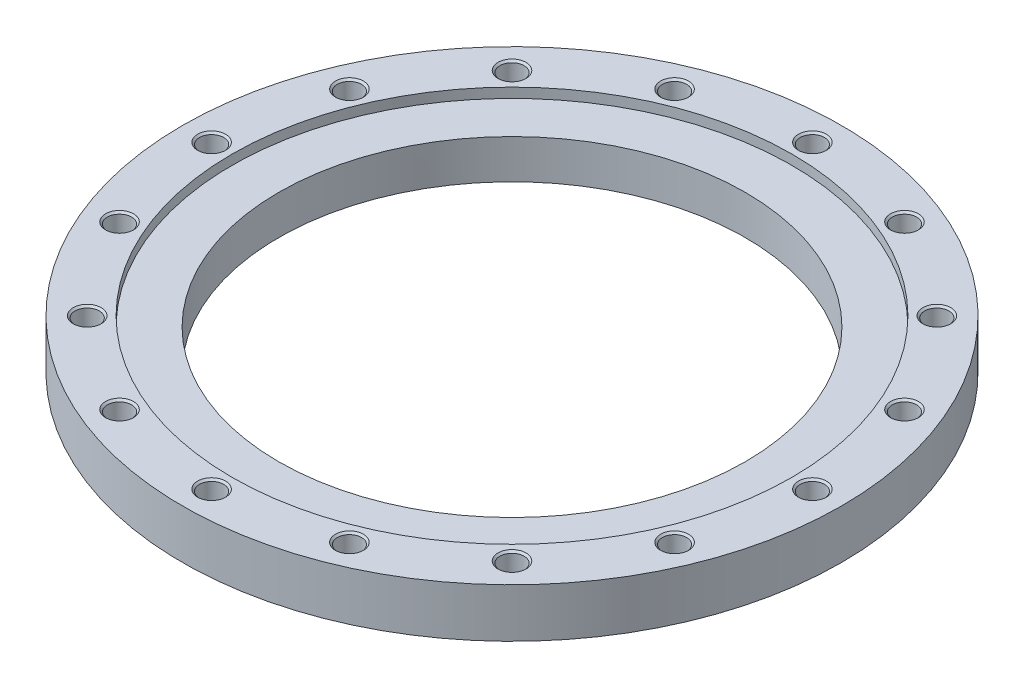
ISO-10303-21;
HEADER;
FILE_DESCRIPTION(('STEP AP214'),'2;1');
FILE_NAME('part.step','',(''),(''),'','','');
FILE_SCHEMA(('AUTOMOTIVE_DESIGN { 1 0 10303 214 1 1 1 1 }'));
ENDSEC;
DATA;
#1=APPLICATION_CONTEXT('core data for automotive mechanical design processes');
#2=APPLICATION_PROTOCOL_DEFINITION('international standard','automotive_design',2000,#1);
#3=PRODUCT_CONTEXT('',#1,'mechanical');
#4=PRODUCT('Part','Part','',(#3));
#5=PRODUCT_RELATED_PRODUCT_CATEGORY('part','',(#4));
#6=PRODUCT_DEFINITION_FORMATION('','',#4);
#7=PRODUCT_DEFINITION_CONTEXT('part definition',#1,'design');
#8=PRODUCT_DEFINITION('design','',#6,#7);
#9=PRODUCT_DEFINITION_SHAPE('','',#8);
#10=(LENGTH_UNIT() NAMED_UNIT(*) SI_UNIT(.MILLI.,.METRE.));
#11=(NAMED_UNIT(*) PLANE_ANGLE_UNIT() SI_UNIT($,.RADIAN.));
#12=(NAMED_UNIT(*) SI_UNIT($,.STERADIAN.) SOLID_ANGLE_UNIT());
#13=UNCERTAINTY_MEASURE_WITH_UNIT(LENGTH_MEASURE(1.E-05),#10,'distance_accuracy_value','');
#14=(GEOMETRIC_REPRESENTATION_CONTEXT(3) GLOBAL_UNCERTAINTY_ASSIGNED_CONTEXT((#13)) GLOBAL_UNIT_ASSIGNED_CONTEXT((#10,
#11,#12)) REPRESENTATION_CONTEXT('',''));
#15=CARTESIAN_POINT('',(0.,0.,0.));
#16=DIRECTION('',(0.,0.,1.));
#17=DIRECTION('',(1.,0.,0.));
#18=AXIS2_PLACEMENT_3D('',#15,#16,#17);
#19=CARTESIAN_POINT('',(0.,21.,0.));
#20=DIRECTION('',(0.,-1.,0.));
#21=DIRECTION('',(1.,0.,0.));
#22=AXIS2_PLACEMENT_3D('',#19,#20,#21);
#23=CYLINDRICAL_SURFACE('',#22,282.5);
#24=CARTESIAN_POINT('',(0.,0.,0.));
#25=DIRECTION('',(0.,1.,0.));
#26=DIRECTION('',(1.,0.,0.));
#27=AXIS2_PLACEMENT_3D('',#24,#25,#26);
#28=CIRCLE('',#27,282.5);
#29=CARTESIAN_POINT('',(282.5,0.,0.));
#30=VERTEX_POINT('',#29);
#31=EDGE_CURVE('E9',#30,#30,#28,.T.);
#32=ORIENTED_EDGE('',*,*,#31,.T.);
#33=EDGE_LOOP('',(#32));
#34=FACE_BOUND('',#33,.T.);
#35=CARTESIAN_POINT('',(0.,42.,0.));
#36=DIRECTION('',(0.,1.,0.));
#37=DIRECTION('',(1.,0.,0.));
#38=AXIS2_PLACEMENT_3D('',#35,#36,#37);
#39=CIRCLE('',#38,282.5);
#40=CARTESIAN_POINT('',(282.5,42.,0.));
#41=VERTEX_POINT('',#40);
#42=EDGE_CURVE('E294',#41,#41,#39,.T.);
#43=ORIENTED_EDGE('',*,*,#42,.F.);
#44=EDGE_LOOP('',(#43));
#45=FACE_BOUND('',#44,.T.);
#46=ADVANCED_FACE('F15',(#34,#45),#23,.T.);
#47=CARTESIAN_POINT('',(241.25,0.,0.));
#48=DIRECTION('',(0.,-1.,0.));
#49=DIRECTION('',(-1.,0.,0.));
#50=AXIS2_PLACEMENT_3D('',#47,#48,#49);
#51=PLANE('',#50);
#52=CARTESIAN_POINT('',(0.,0.,0.));
#53=DIRECTION('',(0.,1.,0.));
#54=DIRECTION('',(1.,0.,0.));
#55=AXIS2_PLACEMENT_3D('',#52,#53,#54);
#56=CIRCLE('',#55,200.);
#57=CARTESIAN_POINT('',(200.,0.,0.));
#58=VERTEX_POINT('',#57);
#59=EDGE_CURVE('E24',#58,#58,#56,.T.);
#60=ORIENTED_EDGE('',*,*,#59,.T.);
#61=EDGE_LOOP('',(#60));
#62=FACE_BOUND('',#61,.T.);
#63=ORIENTED_EDGE('',*,*,#31,.F.);
#64=EDGE_LOOP('',(#63));
#65=FACE_BOUND('',#64,.T.);
#66=ADVANCED_FACE('F17',(#62,#65),#51,.T.);
#67=CARTESIAN_POINT('',(0.,21.,0.));
#68=DIRECTION('',(0.,-1.,0.));
#69=DIRECTION('',(1.,0.,0.));
#70=AXIS2_PLACEMENT_3D('',#67,#68,#69);
#71=CYLINDRICAL_SURFACE('',#70,200.);
#72=ORIENTED_EDGE('',*,*,#59,.F.);
#73=EDGE_LOOP('',(#72));
#74=FACE_BOUND('',#73,.T.);
#75=CARTESIAN_POINT('',(0.,33.6,0.));
#76=DIRECTION('',(0.,1.,0.));
#77=DIRECTION('',(1.,0.,0.));
#78=AXIS2_PLACEMENT_3D('',#75,#76,#77);
#79=CIRCLE('',#78,200.);
#80=CARTESIAN_POINT('',(-200.,33.6,0.));
#81=VERTEX_POINT('',#80);
#82=EDGE_CURVE('E318',#81,#81,#79,.T.);
#83=ORIENTED_EDGE('',*,*,#82,.T.);
#84=EDGE_LOOP('',(#83));
#85=FACE_BOUND('',#84,.T.);
#86=ADVANCED_FACE('F553',(#74,#85),#71,.F.);
#87=CARTESIAN_POINT('',(241.25,42.,0.));
#88=DIRECTION('',(0.,1.,0.));
#89=DIRECTION('',(1.,0.,0.));
#90=AXIS2_PLACEMENT_3D('',#87,#88,#89);
#91=PLANE('',#90);
#92=ORIENTED_EDGE('',*,*,#42,.T.);
#93=EDGE_LOOP('',(#92));
#94=FACE_BOUND('',#93,.T.);
#95=CARTESIAN_POINT('',(0.,42.,0.));
#96=DIRECTION('',(0.,-1.,0.));
#97=DIRECTION('',(1.,0.,0.));
#98=AXIS2_PLACEMENT_3D('',#95,#96,#97);
#99=CIRCLE('',#98,240.);
#100=CARTESIAN_POINT('',(-240.,42.,0.));
#101=VERTEX_POINT('',#100);
#102=EDGE_CURVE('E313',#101,#101,#99,.T.);
#103=ORIENTED_EDGE('',*,*,#102,.T.);
#104=EDGE_LOOP('',(#103));
#105=FACE_BOUND('',#104,.T.);
#106=CARTESIAN_POINT('',(257.5,42.,0.));
#107=DIRECTION('',(0.,-1.,0.));
#108=DIRECTION('',(1.,0.,0.));
#109=AXIS2_PLACEMENT_3D('',#106,#107,#108);
#110=CIRCLE('',#109,12.);
#111=CARTESIAN_POINT('',(269.5,42.,0.));
#112=VERTEX_POINT('',#111);
#113=EDGE_CURVE('E308',#112,#112,#110,.T.);
#114=ORIENTED_EDGE('',*,*,#113,.T.);
#115=EDGE_LOOP('',(#114));
#116=FACE_BOUND('',#115,.T.);
#117=CARTESIAN_POINT('',(237.898979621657,42.,-98.5409838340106));
#118=DIRECTION('',(0.,-1.,0.));
#119=DIRECTION('',(0.923879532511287,0.,-0.38268343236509));
#120=AXIS2_PLACEMENT_3D('',#117,#118,#119);
#121=CIRCLE('',#120,12.);
#122=CARTESIAN_POINT('',(248.985534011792,42.,-103.133185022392));
#123=VERTEX_POINT('',#122);
#124=EDGE_CURVE('E296',#123,#123,#121,.T.);
#125=ORIENTED_EDGE('',*,*,#124,.T.);
#126=EDGE_LOOP('',(#125));
#127=FACE_BOUND('',#126,.T.);
#128=CARTESIAN_POINT('',(182.079996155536,42.,-182.079996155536));
#129=DIRECTION('',(0.,-1.,0.));
#130=DIRECTION('',(0.707106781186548,0.,-0.707106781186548));
#131=AXIS2_PLACEMENT_3D('',#128,#129,#130);
#132=CIRCLE('',#131,12.);
#133=CARTESIAN_POINT('',(190.565277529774,42.,-190.565277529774));
#134=VERTEX_POINT('',#133);
#135=EDGE_CURVE('E288',#134,#134,#132,.T.);
#136=ORIENTED_EDGE('',*,*,#135,.T.);
#137=EDGE_LOOP('',(#136));
#138=FACE_BOUND('',#137,.T.);
#139=CARTESIAN_POINT('',(98.5409838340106,42.,-237.898979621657));
#140=DIRECTION('',(0.,-1.,0.));
#141=DIRECTION('',(0.38268343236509,0.,-0.923879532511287));
#142=AXIS2_PLACEMENT_3D('',#139,#140,#141);
#143=CIRCLE('',#142,12.);
#144=CARTESIAN_POINT('',(103.133185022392,42.,-248.985534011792));
#145=VERTEX_POINT('',#144);
#146=EDGE_CURVE('E277',#145,#145,#143,.T.);
#147=ORIENTED_EDGE('',*,*,#146,.T.);
#148=EDGE_LOOP('',(#147));
#149=FACE_BOUND('',#148,.T.);
#150=CARTESIAN_POINT('',(0.,42.,-257.5));
#151=DIRECTION('',(0.,-1.,0.));
#152=DIRECTION('',(0.,0.,-1.));
#153=AXIS2_PLACEMENT_3D('',#150,#151,#152);
#154=CIRCLE('',#153,12.);
#155=CARTESIAN_POINT('',(0.,42.,-269.5));
#156=VERTEX_POINT('',#155);
#157=EDGE_CURVE('E259',#156,#156,#154,.T.);
#158=ORIENTED_EDGE('',*,*,#157,.T.);
#159=EDGE_LOOP('',(#158));
#160=FACE_BOUND('',#159,.T.);
#161=CARTESIAN_POINT('',(-98.5409838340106,42.,-237.898979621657));
#162=DIRECTION('',(0.,-1.,0.));
#163=DIRECTION('',(-0.38268343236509,0.,-0.923879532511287));
#164=AXIS2_PLACEMENT_3D('',#161,#162,#163);
#165=CIRCLE('',#164,12.);
#166=CARTESIAN_POINT('',(-103.133185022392,42.,-248.985534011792));
#167=VERTEX_POINT('',#166);
#168=EDGE_CURVE('E413',#167,#167,#165,.T.);
#169=ORIENTED_EDGE('',*,*,#168,.T.);
#170=EDGE_LOOP('',(#169));
#171=FACE_BOUND('',#170,.T.);
#172=CARTESIAN_POINT('',(-182.079996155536,42.,-182.079996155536));
#173=DIRECTION('',(0.,-1.,0.));
#174=DIRECTION('',(-0.707106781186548,0.,-0.707106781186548));
#175=AXIS2_PLACEMENT_3D('',#172,#173,#174);
#176=CIRCLE('',#175,12.);
#177=CARTESIAN_POINT('',(-190.565277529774,42.,-190.565277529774));
#178=VERTEX_POINT('',#177);
#179=EDGE_CURVE('E404',#178,#178,#176,.T.);
#180=ORIENTED_EDGE('',*,*,#179,.T.);
#181=EDGE_LOOP('',(#180));
#182=FACE_BOUND('',#181,.T.);
#183=CARTESIAN_POINT('',(-237.898979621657,42.,-98.5409838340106));
#184=DIRECTION('',(0.,-1.,0.));
#185=DIRECTION('',(-0.923879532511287,0.,-0.38268343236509));
#186=AXIS2_PLACEMENT_3D('',#183,#184,#185);
#187=CIRCLE('',#186,12.);
#188=CARTESIAN_POINT('',(-248.985534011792,42.,-103.133185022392));
#189=VERTEX_POINT('',#188);
#190=EDGE_CURVE('E393',#189,#189,#187,.T.);
#191=ORIENTED_EDGE('',*,*,#190,.T.);
#192=EDGE_LOOP('',(#191));
#193=FACE_BOUND('',#192,.T.);
#194=CARTESIAN_POINT('',(-257.5,42.,0.));
#195=DIRECTION('',(0.,-1.,0.));
#196=DIRECTION('',(-1.,0.,0.));
#197=AXIS2_PLACEMENT_3D('',#194,#195,#196);
#198=CIRCLE('',#197,12.);
#199=CARTESIAN_POINT('',(-269.5,42.,0.));
#200=VERTEX_POINT('',#199);
#201=EDGE_CURVE('E338',#200,#200,#198,.T.);
#202=ORIENTED_EDGE('',*,*,#201,.T.);
#203=EDGE_LOOP('',(#202));
#204=FACE_BOUND('',#203,.T.);
#205=CARTESIAN_POINT('',(-237.898979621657,42.,98.5409838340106));
#206=DIRECTION('',(0.,-1.,0.));
#207=DIRECTION('',(-0.923879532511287,0.,0.38268343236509));
#208=AXIS2_PLACEMENT_3D('',#205,#206,#207);
#209=CIRCLE('',#208,12.);
#210=CARTESIAN_POINT('',(-248.985534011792,42.,103.133185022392));
#211=VERTEX_POINT('',#210);
#212=EDGE_CURVE('E368',#211,#211,#209,.T.);
#213=ORIENTED_EDGE('',*,*,#212,.T.);
#214=EDGE_LOOP('',(#213));
#215=FACE_BOUND('',#214,.T.);
#216=CARTESIAN_POINT('',(-182.079996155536,42.,182.079996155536));
#217=DIRECTION('',(0.,-1.,0.));
#218=DIRECTION('',(-0.707106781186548,0.,0.707106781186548));
#219=AXIS2_PLACEMENT_3D('',#216,#217,#218);
#220=CIRCLE('',#219,12.);
#221=CARTESIAN_POINT('',(-190.565277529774,42.,190.565277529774));
#222=VERTEX_POINT('',#221);
#223=EDGE_CURVE('E352',#222,#222,#220,.T.);
#224=ORIENTED_EDGE('',*,*,#223,.T.);
#225=EDGE_LOOP('',(#224));
#226=FACE_BOUND('',#225,.T.);
#227=CARTESIAN_POINT('',(-98.5409838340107,42.,237.898979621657));
#228=DIRECTION('',(0.,-1.,0.));
#229=DIRECTION('',(-0.382683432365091,0.,0.923879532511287));
#230=AXIS2_PLACEMENT_3D('',#227,#228,#229);
#231=CIRCLE('',#230,12.);
#232=CARTESIAN_POINT('',(-103.133185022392,42.,248.985534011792));
#233=VERTEX_POINT('',#232);
#234=EDGE_CURVE('E329',#233,#233,#231,.T.);
#235=ORIENTED_EDGE('',*,*,#234,.T.);
#236=EDGE_LOOP('',(#235));
#237=FACE_BOUND('',#236,.T.);
#238=CARTESIAN_POINT('',(0.,42.,257.5));
#239=DIRECTION('',(0.,-1.,0.));
#240=DIRECTION('',(0.,0.,1.));
#241=AXIS2_PLACEMENT_3D('',#238,#239,#240);
#242=CIRCLE('',#241,12.);
#243=CARTESIAN_POINT('',(0.,42.,269.5));
#244=VERTEX_POINT('',#243);
#245=EDGE_CURVE('E457',#244,#244,#242,.T.);
#246=ORIENTED_EDGE('',*,*,#245,.T.);
#247=EDGE_LOOP('',(#246));
#248=FACE_BOUND('',#247,.T.);
#249=CARTESIAN_POINT('',(98.5409838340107,42.,237.898979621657));
#250=DIRECTION('',(0.,-1.,0.));
#251=DIRECTION('',(0.38268343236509,0.,0.923879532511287));
#252=AXIS2_PLACEMENT_3D('',#249,#250,#251);
#253=CIRCLE('',#252,12.);
#254=CARTESIAN_POINT('',(103.133185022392,42.,248.985534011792));
#255=VERTEX_POINT('',#254);
#256=EDGE_CURVE('E437',#255,#255,#253,.T.);
#257=ORIENTED_EDGE('',*,*,#256,.T.);
#258=EDGE_LOOP('',(#257));
#259=FACE_BOUND('',#258,.T.);
#260=CARTESIAN_POINT('',(182.079996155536,42.,182.079996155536));
#261=DIRECTION('',(0.,-1.,0.));
#262=DIRECTION('',(0.707106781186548,0.,0.707106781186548));
#263=AXIS2_PLACEMENT_3D('',#260,#261,#262);
#264=CIRCLE('',#263,12.);
#265=CARTESIAN_POINT('',(190.565277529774,42.,190.565277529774));
#266=VERTEX_POINT('',#265);
#267=EDGE_CURVE('E429',#266,#266,#264,.T.);
#268=ORIENTED_EDGE('',*,*,#267,.T.);
#269=EDGE_LOOP('',(#268));
#270=FACE_BOUND('',#269,.T.);
#271=CARTESIAN_POINT('',(237.898979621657,42.,98.5409838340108));
#272=DIRECTION('',(0.,-1.,0.));
#273=DIRECTION('',(0.923879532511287,0.,0.382683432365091));
#274=AXIS2_PLACEMENT_3D('',#271,#272,#273);
#275=CIRCLE('',#274,12.);
#276=CARTESIAN_POINT('',(248.985534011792,42.,103.133185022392));
#277=VERTEX_POINT('',#276);
#278=EDGE_CURVE('E489',#277,#277,#275,.T.);
#279=ORIENTED_EDGE('',*,*,#278,.T.);
#280=EDGE_LOOP('',(#279));
#281=FACE_BOUND('',#280,.T.);
#282=ADVANCED_FACE('F753',(#94,#105,#116,#127,#138,#149,#160,#171,#182,#193,#204,#215,#226,#237,
#248,#259,#270,#281),#91,.T.);
#283=CARTESIAN_POINT('',(0.,33.6,0.));
#284=DIRECTION('',(0.,-1.,0.));
#285=DIRECTION('',(-1.,0.,0.));
#286=AXIS2_PLACEMENT_3D('',#283,#284,#285);
#287=PLANE('',#286);
#288=CARTESIAN_POINT('',(0.,33.6,0.));
#289=DIRECTION('',(0.,-1.,0.));
#290=DIRECTION('',(1.,0.,0.));
#291=AXIS2_PLACEMENT_3D('',#288,#289,#290);
#292=CIRCLE('',#291,240.);
#293=CARTESIAN_POINT('',(240.,33.6,0.));
#294=VERTEX_POINT('',#293);
#295=EDGE_CURVE('E316',#294,#294,#292,.T.);
#296=ORIENTED_EDGE('',*,*,#295,.F.);
#297=EDGE_LOOP('',(#296));
#298=FACE_BOUND('',#297,.T.);
#299=ORIENTED_EDGE('',*,*,#82,.F.);
#300=EDGE_LOOP('',(#299));
#301=FACE_BOUND('',#300,.T.);
#302=ADVANCED_FACE('F643',(#298,#301),#287,.F.);
#303=CARTESIAN_POINT('',(0.,39.9,0.));
#304=DIRECTION('',(0.,-1.,0.));
#305=DIRECTION('',(1.,0.,0.));
#306=AXIS2_PLACEMENT_3D('',#303,#304,#305);
#307=CYLINDRICAL_SURFACE('',#306,240.);
#308=ORIENTED_EDGE('',*,*,#295,.T.);
#309=EDGE_LOOP('',(#308));
#310=FACE_BOUND('',#309,.T.);
#311=ORIENTED_EDGE('',*,*,#102,.F.);
#312=EDGE_LOOP('',(#311));
#313=FACE_BOUND('',#312,.T.);
#314=ADVANCED_FACE('F639',(#310,#313),#307,.F.);
#315=CARTESIAN_POINT('',(257.5,6.00463463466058,0.));
#316=DIRECTION('',(0.,1.,0.));
#317=DIRECTION('',(1.,0.,0.));
#318=AXIS2_PLACEMENT_3D('',#315,#316,#317);
#319=CONICAL_SURFACE('',#318,5.188125,1.0471975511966);
#320=CARTESIAN_POINT('',(257.5,9.,0.));
#321=DIRECTION('',(0.,-1.,0.));
#322=DIRECTION('',(1.,0.,0.));
#323=AXIS2_PLACEMENT_3D('',#320,#321,#322);
#324=CIRCLE('',#323,10.37625);
#325=CARTESIAN_POINT('',(267.87625,9.,0.));
#326=VERTEX_POINT('',#325);
#327=EDGE_CURVE('E311',#326,#326,#324,.T.);
#328=ORIENTED_EDGE('',*,*,#327,.F.);
#329=EDGE_LOOP('',(#328));
#330=FACE_BOUND('',#329,.T.);
#331=CARTESIAN_POINT('',(257.5,3.00926926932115,0.));
#332=VERTEX_POINT('',#331);
#333=VERTEX_LOOP('',#332);
#334=FACE_BOUND('',#333,.T.);
#335=ADVANCED_FACE('F642',(#330,#334),#319,.F.);
#336=CARTESIAN_POINT('',(257.5,12.688125,0.));
#337=DIRECTION('',(0.,1.,0.));
#338=DIRECTION('',(1.,0.,0.));
#339=AXIS2_PLACEMENT_3D('',#336,#337,#338);
#340=CYLINDRICAL_SURFACE('',#339,10.37625);
#341=CARTESIAN_POINT('',(257.5,16.37625,0.));
#342=DIRECTION('',(0.,-1.,0.));
#343=DIRECTION('',(1.,0.,0.));
#344=AXIS2_PLACEMENT_3D('',#341,#342,#343);
#345=CIRCLE('',#344,10.37625);
#346=CARTESIAN_POINT('',(267.87625,16.37625,0.));
#347=VERTEX_POINT('',#346);
#348=EDGE_CURVE('E309',#347,#347,#345,.T.);
#349=ORIENTED_EDGE('',*,*,#348,.F.);
#350=EDGE_LOOP('',(#349));
#351=FACE_BOUND('',#350,.T.);
#352=ORIENTED_EDGE('',*,*,#327,.T.);
#353=EDGE_LOOP('',(#352));
#354=FACE_BOUND('',#353,.T.);
#355=ADVANCED_FACE('F607',(#351,#354),#340,.F.);
#356=CARTESIAN_POINT('',(257.5,17.188125,0.));
#357=DIRECTION('',(0.,1.,0.));
#358=DIRECTION('',(1.,0.,0.));
#359=AXIS2_PLACEMENT_3D('',#356,#357,#358);
#360=CONICAL_SURFACE('',#359,11.188125,0.785398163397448);
#361=CARTESIAN_POINT('',(257.5,18.,0.));
#362=DIRECTION('',(0.,-1.,0.));
#363=DIRECTION('',(1.,0.,0.));
#364=AXIS2_PLACEMENT_3D('',#361,#362,#363);
#365=CIRCLE('',#364,12.);
#366=CARTESIAN_POINT('',(269.5,18.,0.));
#367=VERTEX_POINT('',#366);
#368=EDGE_CURVE('E312',#367,#367,#365,.T.);
#369=ORIENTED_EDGE('',*,*,#368,.F.);
#370=EDGE_LOOP('',(#369));
#371=FACE_BOUND('',#370,.T.);
#372=ORIENTED_EDGE('',*,*,#348,.T.);
#373=EDGE_LOOP('',(#372));
#374=FACE_BOUND('',#373,.T.);
#375=ADVANCED_FACE('F603',(#371,#374),#360,.F.);
#376=CARTESIAN_POINT('',(268.688125,18.,0.));
#377=DIRECTION('',(0.,1.,0.));
#378=DIRECTION('',(-1.,0.,0.));
#379=AXIS2_PLACEMENT_3D('',#376,#377,#378);
#380=PLANE('',#379);
#381=CARTESIAN_POINT('',(257.5,18.,0.));
#382=DIRECTION('',(0.,-1.,0.));
#383=DIRECTION('',(1.,0.,0.));
#384=AXIS2_PLACEMENT_3D('',#381,#382,#383);
#385=CIRCLE('',#384,10.37625);
#386=CARTESIAN_POINT('',(267.87625,18.,0.));
#387=VERTEX_POINT('',#386);
#388=EDGE_CURVE('E373',#387,#387,#385,.T.);
#389=ORIENTED_EDGE('',*,*,#388,.F.);
#390=EDGE_LOOP('',(#389));
#391=FACE_BOUND('',#390,.T.);
#392=ORIENTED_EDGE('',*,*,#368,.T.);
#393=EDGE_LOOP('',(#392));
#394=FACE_BOUND('',#393,.T.);
#395=ADVANCED_FACE('F606',(#391,#394),#380,.F.);
#396=CARTESIAN_POINT('',(257.5,29.188125,0.));
#397=DIRECTION('',(0.,1.,0.));
#398=DIRECTION('',(1.,0.,0.));
#399=AXIS2_PLACEMENT_3D('',#396,#397,#398);
#400=CYLINDRICAL_SURFACE('',#399,10.37625);
#401=CARTESIAN_POINT('',(257.5,40.37625,0.));
#402=DIRECTION('',(0.,-1.,0.));
#403=DIRECTION('',(1.,0.,0.));
#404=AXIS2_PLACEMENT_3D('',#401,#402,#403);
#405=CIRCLE('',#404,10.37625);
#406=CARTESIAN_POINT('',(267.87625,40.37625,0.));
#407=VERTEX_POINT('',#406);
#408=EDGE_CURVE('E306',#407,#407,#405,.T.);
#409=ORIENTED_EDGE('',*,*,#408,.F.);
#410=EDGE_LOOP('',(#409));
#411=FACE_BOUND('',#410,.T.);
#412=ORIENTED_EDGE('',*,*,#388,.T.);
#413=EDGE_LOOP('',(#412));
#414=FACE_BOUND('',#413,.T.);
#415=ADVANCED_FACE('F750',(#411,#414),#400,.F.);
#416=CARTESIAN_POINT('',(257.5,41.188125,0.));
#417=DIRECTION('',(0.,1.,0.));
#418=DIRECTION('',(1.,0.,0.));
#419=AXIS2_PLACEMENT_3D('',#416,#417,#418);
#420=CONICAL_SURFACE('',#419,11.188125,0.785398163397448);
#421=ORIENTED_EDGE('',*,*,#113,.F.);
#422=EDGE_LOOP('',(#421));
#423=FACE_BOUND('',#422,.T.);
#424=ORIENTED_EDGE('',*,*,#408,.T.);
#425=EDGE_LOOP('',(#424));
#426=FACE_BOUND('',#425,.T.);
#427=ADVANCED_FACE('F746',(#423,#426),#420,.F.);
#428=CARTESIAN_POINT('',(237.898979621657,6.00463463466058,-98.5409838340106));
#429=DIRECTION('',(0.,1.,0.));
#430=DIRECTION('',(0.923879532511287,0.,-0.38268343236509));
#431=AXIS2_PLACEMENT_3D('',#428,#429,#430);
#432=CONICAL_SURFACE('',#431,5.188125,1.0471975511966);
#433=CARTESIAN_POINT('',(237.898979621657,9.,-98.5409838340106));
#434=DIRECTION('',(0.,-1.,0.));
#435=DIRECTION('',(0.923879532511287,0.,-0.38268343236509));
#436=AXIS2_PLACEMENT_3D('',#433,#434,#435);
#437=CIRCLE('',#436,10.37625);
#438=CARTESIAN_POINT('',(247.485384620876,9.,-102.511802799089));
#439=VERTEX_POINT('',#438);
#440=EDGE_CURVE('E304',#439,#439,#437,.T.);
#441=ORIENTED_EDGE('',*,*,#440,.F.);
#442=EDGE_LOOP('',(#441));
#443=FACE_BOUND('',#442,.T.);
#444=CARTESIAN_POINT('',(237.898979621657,3.00926926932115,-98.5409838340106));
#445=VERTEX_POINT('',#444);
#446=VERTEX_LOOP('',#445);
#447=FACE_BOUND('',#446,.T.);
#448=ADVANCED_FACE('F575',(#443,#447),#432,.F.);
#449=CARTESIAN_POINT('',(237.898979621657,12.688125,-98.5409838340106));
#450=DIRECTION('',(0.,1.,0.));
#451=DIRECTION('',(0.923879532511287,0.,-0.38268343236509));
#452=AXIS2_PLACEMENT_3D('',#449,#450,#451);
#453=CYLINDRICAL_SURFACE('',#452,10.37625);
#454=CARTESIAN_POINT('',(237.898979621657,16.37625,-98.5409838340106));
#455=DIRECTION('',(0.,-1.,0.));
#456=DIRECTION('',(0.923879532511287,0.,-0.38268343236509));
#457=AXIS2_PLACEMENT_3D('',#454,#455,#456);
#458=CIRCLE('',#457,10.37625);
#459=CARTESIAN_POINT('',(247.485384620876,16.37625,-102.511802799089));
#460=VERTEX_POINT('',#459);
#461=EDGE_CURVE('E302',#460,#460,#458,.T.);
#462=ORIENTED_EDGE('',*,*,#461,.F.);
#463=EDGE_LOOP('',(#462));
#464=FACE_BOUND('',#463,.T.);
#465=ORIENTED_EDGE('',*,*,#440,.T.);
#466=EDGE_LOOP('',(#465));
#467=FACE_BOUND('',#466,.T.);
#468=ADVANCED_FACE('F571',(#464,#467),#453,.F.);
#469=CARTESIAN_POINT('',(237.898979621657,17.188125,-98.5409838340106));
#470=DIRECTION('',(0.,1.,0.));
#471=DIRECTION('',(0.923879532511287,0.,-0.38268343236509));
#472=AXIS2_PLACEMENT_3D('',#469,#470,#471);
#473=CONICAL_SURFACE('',#472,11.188125,0.785398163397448);
#474=CARTESIAN_POINT('',(237.898979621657,18.,-98.5409838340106));
#475=DIRECTION('',(0.,-1.,0.));
#476=DIRECTION('',(0.923879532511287,0.,-0.38268343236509));
#477=AXIS2_PLACEMENT_3D('',#474,#475,#476);
#478=CIRCLE('',#477,12.);
#479=CARTESIAN_POINT('',(248.985534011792,18.,-103.133185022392));
#480=VERTEX_POINT('',#479);
#481=EDGE_CURVE('E301',#480,#480,#478,.T.);
#482=ORIENTED_EDGE('',*,*,#481,.F.);
#483=EDGE_LOOP('',(#482));
#484=FACE_BOUND('',#483,.T.);
#485=ORIENTED_EDGE('',*,*,#461,.T.);
#486=EDGE_LOOP('',(#485));
#487=FACE_BOUND('',#486,.T.);
#488=ADVANCED_FACE('F574',(#484,#487),#473,.F.);
#489=CARTESIAN_POINT('',(248.235459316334,18.,-102.82249391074));
#490=DIRECTION('',(0.,1.,0.));
#491=DIRECTION('',(-0.923879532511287,0.,0.38268343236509));
#492=AXIS2_PLACEMENT_3D('',#489,#490,#491);
#493=PLANE('',#492);
#494=CARTESIAN_POINT('',(237.898979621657,18.,-98.5409838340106));
#495=DIRECTION('',(0.,-1.,0.));
#496=DIRECTION('',(0.923879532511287,0.,-0.38268343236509));
#497=AXIS2_PLACEMENT_3D('',#494,#495,#496);
#498=CIRCLE('',#497,10.37625);
#499=CARTESIAN_POINT('',(247.485384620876,18.,-102.511802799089));
#500=VERTEX_POINT('',#499);
#501=EDGE_CURVE('E298',#500,#500,#498,.T.);
#502=ORIENTED_EDGE('',*,*,#501,.F.);
#503=EDGE_LOOP('',(#502));
#504=FACE_BOUND('',#503,.T.);
#505=ORIENTED_EDGE('',*,*,#481,.T.);
#506=EDGE_LOOP('',(#505));
#507=FACE_BOUND('',#506,.T.);
#508=ADVANCED_FACE('F742',(#504,#507),#493,.F.);
#509=CARTESIAN_POINT('',(237.898979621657,29.188125,-98.5409838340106));
#510=DIRECTION('',(0.,1.,0.));
#511=DIRECTION('',(0.923879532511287,0.,-0.38268343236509));
#512=AXIS2_PLACEMENT_3D('',#509,#510,#511);
#513=CYLINDRICAL_SURFACE('',#512,10.37625);
#514=CARTESIAN_POINT('',(237.898979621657,40.37625,-98.5409838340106));
#515=DIRECTION('',(0.,-1.,0.));
#516=DIRECTION('',(0.923879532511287,0.,-0.38268343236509));
#517=AXIS2_PLACEMENT_3D('',#514,#515,#516);
#518=CIRCLE('',#517,10.37625);
#519=CARTESIAN_POINT('',(247.485384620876,40.37625,-102.511802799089));
#520=VERTEX_POINT('',#519);
#521=EDGE_CURVE('E291',#520,#520,#518,.T.);
#522=ORIENTED_EDGE('',*,*,#521,.F.);
#523=EDGE_LOOP('',(#522));
#524=FACE_BOUND('',#523,.T.);
#525=ORIENTED_EDGE('',*,*,#501,.T.);
#526=EDGE_LOOP('',(#525));
#527=FACE_BOUND('',#526,.T.);
#528=ADVANCED_FACE('F543',(#524,#527),#513,.F.);
#529=CARTESIAN_POINT('',(237.898979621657,41.188125,-98.5409838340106));
#530=DIRECTION('',(0.,1.,0.));
#531=DIRECTION('',(0.923879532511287,0.,-0.38268343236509));
#532=AXIS2_PLACEMENT_3D('',#529,#530,#531);
#533=CONICAL_SURFACE('',#532,11.188125,0.785398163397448);
#534=ORIENTED_EDGE('',*,*,#124,.F.);
#535=EDGE_LOOP('',(#534));
#536=FACE_BOUND('',#535,.T.);
#537=ORIENTED_EDGE('',*,*,#521,.T.);
#538=EDGE_LOOP('',(#537));
#539=FACE_BOUND('',#538,.T.);
#540=ADVANCED_FACE('F537',(#536,#539),#533,.F.);
#541=CARTESIAN_POINT('',(182.079996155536,6.00463463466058,-182.079996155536));
#542=DIRECTION('',(0.,1.,0.));
#543=DIRECTION('',(0.707106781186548,0.,-0.707106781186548));
#544=AXIS2_PLACEMENT_3D('',#541,#542,#543);
#545=CONICAL_SURFACE('',#544,5.188125,1.0471975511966);
#546=CARTESIAN_POINT('',(182.079996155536,9.,-182.079996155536));
#547=DIRECTION('',(0.,-1.,0.));
#548=DIRECTION('',(0.707106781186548,0.,-0.707106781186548));
#549=AXIS2_PLACEMENT_3D('',#546,#547,#548);
#550=CIRCLE('',#549,10.37625);
#551=CARTESIAN_POINT('',(189.417112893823,9.,-189.417112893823));
#552=VERTEX_POINT('',#551);
#553=EDGE_CURVE('E289',#552,#552,#550,.T.);
#554=ORIENTED_EDGE('',*,*,#553,.F.);
#555=EDGE_LOOP('',(#554));
#556=FACE_BOUND('',#555,.T.);
#557=CARTESIAN_POINT('',(182.079996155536,3.00926926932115,-182.079996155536));
#558=VERTEX_POINT('',#557);
#559=VERTEX_LOOP('',#558);
#560=FACE_BOUND('',#559,.T.);
#561=ADVANCED_FACE('F531',(#556,#560),#545,.F.);
#562=CARTESIAN_POINT('',(182.079996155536,12.688125,-182.079996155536));
#563=DIRECTION('',(0.,1.,0.));
#564=DIRECTION('',(0.707106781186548,0.,-0.707106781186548));
#565=AXIS2_PLACEMENT_3D('',#562,#563,#564);
#566=CYLINDRICAL_SURFACE('',#565,10.37625);
#567=CARTESIAN_POINT('',(182.079996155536,16.37625,-182.079996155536));
#568=DIRECTION('',(0.,-1.,0.));
#569=DIRECTION('',(0.707106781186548,0.,-0.707106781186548));
#570=AXIS2_PLACEMENT_3D('',#567,#568,#569);
#571=CIRCLE('',#570,10.37625);
#572=CARTESIAN_POINT('',(189.417112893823,16.37625,-189.417112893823));
#573=VERTEX_POINT('',#572);
#574=EDGE_CURVE('E292',#573,#573,#571,.T.);
#575=ORIENTED_EDGE('',*,*,#574,.F.);
#576=EDGE_LOOP('',(#575));
#577=FACE_BOUND('',#576,.T.);
#578=ORIENTED_EDGE('',*,*,#553,.T.);
#579=EDGE_LOOP('',(#578));
#580=FACE_BOUND('',#579,.T.);
#581=ADVANCED_FACE('F524',(#577,#580),#566,.F.);
#582=CARTESIAN_POINT('',(182.079996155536,17.188125,-182.079996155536));
#583=DIRECTION('',(0.,1.,0.));
#584=DIRECTION('',(0.707106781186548,0.,-0.707106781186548));
#585=AXIS2_PLACEMENT_3D('',#582,#583,#584);
#586=CONICAL_SURFACE('',#585,11.188125,0.785398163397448);
#587=CARTESIAN_POINT('',(182.079996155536,18.,-182.079996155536));
#588=DIRECTION('',(0.,-1.,0.));
#589=DIRECTION('',(0.707106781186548,0.,-0.707106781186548));
#590=AXIS2_PLACEMENT_3D('',#587,#588,#589);
#591=CIRCLE('',#590,12.);
#592=CARTESIAN_POINT('',(190.565277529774,18.,-190.565277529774));
#593=VERTEX_POINT('',#592);
#594=EDGE_CURVE('E468',#593,#593,#591,.T.);
#595=ORIENTED_EDGE('',*,*,#594,.F.);
#596=EDGE_LOOP('',(#595));
#597=FACE_BOUND('',#596,.T.);
#598=ORIENTED_EDGE('',*,*,#574,.T.);
#599=EDGE_LOOP('',(#598));
#600=FACE_BOUND('',#599,.T.);
#601=ADVANCED_FACE('F517',(#597,#600),#586,.F.);
#602=CARTESIAN_POINT('',(189.991195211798,18.,-189.991195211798));
#603=DIRECTION('',(0.,1.,0.));
#604=DIRECTION('',(-0.707106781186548,0.,0.707106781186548));
#605=AXIS2_PLACEMENT_3D('',#602,#603,#604);
#606=PLANE('',#605);
#607=CARTESIAN_POINT('',(182.079996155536,18.,-182.079996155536));
#608=DIRECTION('',(0.,-1.,0.));
#609=DIRECTION('',(0.707106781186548,0.,-0.707106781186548));
#610=AXIS2_PLACEMENT_3D('',#607,#608,#609);
#611=CIRCLE('',#610,10.37625);
#612=CARTESIAN_POINT('',(189.417112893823,18.,-189.417112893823));
#613=VERTEX_POINT('',#612);
#614=EDGE_CURVE('E440',#613,#613,#611,.T.);
#615=ORIENTED_EDGE('',*,*,#614,.F.);
#616=EDGE_LOOP('',(#615));
#617=FACE_BOUND('',#616,.T.);
#618=ORIENTED_EDGE('',*,*,#594,.T.);
#619=EDGE_LOOP('',(#618));
#620=FACE_BOUND('',#619,.T.);
#621=ADVANCED_FACE('F514',(#617,#620),#606,.F.);
#622=CARTESIAN_POINT('',(182.079996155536,29.188125,-182.079996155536));
#623=DIRECTION('',(0.,1.,0.));
#624=DIRECTION('',(0.707106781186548,0.,-0.707106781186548));
#625=AXIS2_PLACEMENT_3D('',#622,#623,#624);
#626=CYLINDRICAL_SURFACE('',#625,10.37625);
#627=CARTESIAN_POINT('',(182.079996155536,40.37625,-182.079996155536));
#628=DIRECTION('',(0.,-1.,0.));
#629=DIRECTION('',(0.707106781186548,0.,-0.707106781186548));
#630=AXIS2_PLACEMENT_3D('',#627,#628,#629);
#631=CIRCLE('',#630,10.37625);
#632=CARTESIAN_POINT('',(189.417112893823,40.37625,-189.417112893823));
#633=VERTEX_POINT('',#632);
#634=EDGE_CURVE('E286',#633,#633,#631,.T.);
#635=ORIENTED_EDGE('',*,*,#634,.F.);
#636=EDGE_LOOP('',(#635));
#637=FACE_BOUND('',#636,.T.);
#638=ORIENTED_EDGE('',*,*,#614,.T.);
#639=EDGE_LOOP('',(#638));
#640=FACE_BOUND('',#639,.T.);
#641=ADVANCED_FACE('F512',(#637,#640),#626,.F.);
#642=CARTESIAN_POINT('',(182.079996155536,41.188125,-182.079996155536));
#643=DIRECTION('',(0.,1.,0.));
#644=DIRECTION('',(0.707106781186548,0.,-0.707106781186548));
#645=AXIS2_PLACEMENT_3D('',#642,#643,#644);
#646=CONICAL_SURFACE('',#645,11.188125,0.785398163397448);
#647=ORIENTED_EDGE('',*,*,#135,.F.);
#648=EDGE_LOOP('',(#647));
#649=FACE_BOUND('',#648,.T.);
#650=ORIENTED_EDGE('',*,*,#634,.T.);
#651=EDGE_LOOP('',(#650));
#652=FACE_BOUND('',#651,.T.);
#653=ADVANCED_FACE('F733',(#649,#652),#646,.F.);
#654=CARTESIAN_POINT('',(98.5409838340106,6.00463463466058,-237.898979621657));
#655=DIRECTION('',(0.,1.,0.));
#656=DIRECTION('',(0.38268343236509,0.,-0.923879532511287));
#657=AXIS2_PLACEMENT_3D('',#654,#655,#656);
#658=CONICAL_SURFACE('',#657,5.188125,1.0471975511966);
#659=CARTESIAN_POINT('',(98.5409838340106,9.,-237.898979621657));
#660=DIRECTION('',(0.,-1.,0.));
#661=DIRECTION('',(0.38268343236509,0.,-0.923879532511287));
#662=AXIS2_PLACEMENT_3D('',#659,#660,#661);
#663=CIRCLE('',#662,10.37625);
#664=CARTESIAN_POINT('',(102.511802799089,9.,-247.485384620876));
#665=VERTEX_POINT('',#664);
#666=EDGE_CURVE('E282',#665,#665,#663,.T.);
#667=ORIENTED_EDGE('',*,*,#666,.F.);
#668=EDGE_LOOP('',(#667));
#669=FACE_BOUND('',#668,.T.);
#670=CARTESIAN_POINT('',(98.5409838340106,3.00926926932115,-237.898979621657));
#671=VERTEX_POINT('',#670);
#672=VERTEX_LOOP('',#671);
#673=FACE_BOUND('',#672,.T.);
#674=ADVANCED_FACE('F731',(#669,#673),#658,.F.);
#675=CARTESIAN_POINT('',(98.5409838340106,12.688125,-237.898979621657));
#676=DIRECTION('',(0.,1.,0.));
#677=DIRECTION('',(0.38268343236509,0.,-0.923879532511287));
#678=AXIS2_PLACEMENT_3D('',#675,#676,#677);
#679=CYLINDRICAL_SURFACE('',#678,10.37625);
#680=CARTESIAN_POINT('',(98.5409838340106,16.37625,-237.898979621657));
#681=DIRECTION('',(0.,-1.,0.));
#682=DIRECTION('',(0.38268343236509,0.,-0.923879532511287));
#683=AXIS2_PLACEMENT_3D('',#680,#681,#682);
#684=CIRCLE('',#683,10.37625);
#685=CARTESIAN_POINT('',(102.511802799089,16.37625,-247.485384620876));
#686=VERTEX_POINT('',#685);
#687=EDGE_CURVE('E280',#686,#686,#684,.T.);
#688=ORIENTED_EDGE('',*,*,#687,.F.);
#689=EDGE_LOOP('',(#688));
#690=FACE_BOUND('',#689,.T.);
#691=ORIENTED_EDGE('',*,*,#666,.T.);
#692=EDGE_LOOP('',(#691));
#693=FACE_BOUND('',#692,.T.);
#694=ADVANCED_FACE('F727',(#690,#693),#679,.F.);
#695=CARTESIAN_POINT('',(98.5409838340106,17.188125,-237.898979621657));
#696=DIRECTION('',(0.,1.,0.));
#697=DIRECTION('',(0.38268343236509,0.,-0.923879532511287));
#698=AXIS2_PLACEMENT_3D('',#695,#696,#697);
#699=CONICAL_SURFACE('',#698,11.188125,0.785398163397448);
#700=CARTESIAN_POINT('',(98.5409838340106,18.,-237.898979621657));
#701=DIRECTION('',(0.,-1.,0.));
#702=DIRECTION('',(0.38268343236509,0.,-0.923879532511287));
#703=AXIS2_PLACEMENT_3D('',#700,#701,#702);
#704=CIRCLE('',#703,12.);
#705=CARTESIAN_POINT('',(103.133185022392,18.,-248.985534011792));
#706=VERTEX_POINT('',#705);
#707=EDGE_CURVE('E283',#706,#706,#704,.T.);
#708=ORIENTED_EDGE('',*,*,#707,.F.);
#709=EDGE_LOOP('',(#708));
#710=FACE_BOUND('',#709,.T.);
#711=ORIENTED_EDGE('',*,*,#687,.T.);
#712=EDGE_LOOP('',(#711));
#713=FACE_BOUND('',#712,.T.);
#714=ADVANCED_FACE('F730',(#710,#713),#699,.F.);
#715=CARTESIAN_POINT('',(102.82249391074,18.,-248.235459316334));
#716=DIRECTION('',(0.,1.,0.));
#717=DIRECTION('',(-0.38268343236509,0.,0.923879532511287));
#718=AXIS2_PLACEMENT_3D('',#715,#716,#717);
#719=PLANE('',#718);
#720=CARTESIAN_POINT('',(98.5409838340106,18.,-237.898979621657));
#721=DIRECTION('',(0.,-1.,0.));
#722=DIRECTION('',(0.38268343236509,0.,-0.923879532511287));
#723=AXIS2_PLACEMENT_3D('',#720,#721,#722);
#724=CIRCLE('',#723,10.37625);
#725=CARTESIAN_POINT('',(102.511802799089,18.,-247.485384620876));
#726=VERTEX_POINT('',#725);
#727=EDGE_CURVE('E279',#726,#726,#724,.T.);
#728=ORIENTED_EDGE('',*,*,#727,.F.);
#729=EDGE_LOOP('',(#728));
#730=FACE_BOUND('',#729,.T.);
#731=ORIENTED_EDGE('',*,*,#707,.T.);
#732=EDGE_LOOP('',(#731));
#733=FACE_BOUND('',#732,.T.);
#734=ADVANCED_FACE('F725',(#730,#733),#719,.F.);
#735=CARTESIAN_POINT('',(98.5409838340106,29.188125,-237.898979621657));
#736=DIRECTION('',(0.,1.,0.));
#737=DIRECTION('',(0.38268343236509,0.,-0.923879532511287));
#738=AXIS2_PLACEMENT_3D('',#735,#736,#737);
#739=CYLINDRICAL_SURFACE('',#738,10.37625);
#740=CARTESIAN_POINT('',(98.5409838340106,40.37625,-237.898979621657));
#741=DIRECTION('',(0.,-1.,0.));
#742=DIRECTION('',(0.38268343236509,0.,-0.923879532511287));
#743=AXIS2_PLACEMENT_3D('',#740,#741,#742);
#744=CIRCLE('',#743,10.37625);
#745=CARTESIAN_POINT('',(102.511802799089,40.37625,-247.485384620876));
#746=VERTEX_POINT('',#745);
#747=EDGE_CURVE('E275',#746,#746,#744,.T.);
#748=ORIENTED_EDGE('',*,*,#747,.F.);
#749=EDGE_LOOP('',(#748));
#750=FACE_BOUND('',#749,.T.);
#751=ORIENTED_EDGE('',*,*,#727,.T.);
#752=EDGE_LOOP('',(#751));
#753=FACE_BOUND('',#752,.T.);
#754=ADVANCED_FACE('F721',(#750,#753),#739,.F.);
#755=CARTESIAN_POINT('',(98.5409838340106,41.188125,-237.898979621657));
#756=DIRECTION('',(0.,1.,0.));
#757=DIRECTION('',(0.38268343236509,0.,-0.923879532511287));
#758=AXIS2_PLACEMENT_3D('',#755,#756,#757);
#759=CONICAL_SURFACE('',#758,11.188125,0.785398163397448);
#760=ORIENTED_EDGE('',*,*,#146,.F.);
#761=EDGE_LOOP('',(#760));
#762=FACE_BOUND('',#761,.T.);
#763=ORIENTED_EDGE('',*,*,#747,.T.);
#764=EDGE_LOOP('',(#763));
#765=FACE_BOUND('',#764,.T.);
#766=ADVANCED_FACE('F717',(#762,#765),#759,.F.);
#767=CARTESIAN_POINT('',(0.,6.00463463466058,-257.5));
#768=DIRECTION('',(0.,1.,0.));
#769=DIRECTION('',(0.,0.,-1.));
#770=AXIS2_PLACEMENT_3D('',#767,#768,#769);
#771=CONICAL_SURFACE('',#770,5.188125,1.0471975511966);
#772=CARTESIAN_POINT('',(0.,9.,-257.5));
#773=DIRECTION('',(0.,-1.,0.));
#774=DIRECTION('',(0.,0.,-1.));
#775=AXIS2_PLACEMENT_3D('',#772,#773,#774);
#776=CIRCLE('',#775,10.37625);
#777=CARTESIAN_POINT('',(0.,9.,-267.87625));
#778=VERTEX_POINT('',#777);
#779=EDGE_CURVE('E273',#778,#778,#776,.T.);
#780=ORIENTED_EDGE('',*,*,#779,.F.);
#781=EDGE_LOOP('',(#780));
#782=FACE_BOUND('',#781,.T.);
#783=CARTESIAN_POINT('',(0.,3.00926926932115,-257.5));
#784=VERTEX_POINT('',#783);
#785=VERTEX_LOOP('',#784);
#786=FACE_BOUND('',#785,.T.);
#787=ADVANCED_FACE('F714',(#782,#786),#771,.F.);
#788=CARTESIAN_POINT('',(0.,12.688125,-257.5));
#789=DIRECTION('',(0.,1.,0.));
#790=DIRECTION('',(0.,0.,-1.));
#791=AXIS2_PLACEMENT_3D('',#788,#789,#790);
#792=CYLINDRICAL_SURFACE('',#791,10.37625);
#793=CARTESIAN_POINT('',(0.,16.37625,-257.5));
#794=DIRECTION('',(0.,-1.,0.));
#795=DIRECTION('',(0.,0.,-1.));
#796=AXIS2_PLACEMENT_3D('',#793,#794,#795);
#797=CIRCLE('',#796,10.37625);
#798=CARTESIAN_POINT('',(0.,16.37625,-267.87625));
#799=VERTEX_POINT('',#798);
#800=EDGE_CURVE('E272',#799,#799,#797,.T.);
#801=ORIENTED_EDGE('',*,*,#800,.F.);
#802=EDGE_LOOP('',(#801));
#803=FACE_BOUND('',#802,.T.);
#804=ORIENTED_EDGE('',*,*,#779,.T.);
#805=EDGE_LOOP('',(#804));
#806=FACE_BOUND('',#805,.T.);
#807=ADVANCED_FACE('F585',(#803,#806),#792,.F.);
#808=CARTESIAN_POINT('',(0.,17.188125,-257.5));
#809=DIRECTION('',(0.,1.,0.));
#810=DIRECTION('',(0.,0.,-1.));
#811=AXIS2_PLACEMENT_3D('',#808,#809,#810);
#812=CONICAL_SURFACE('',#811,11.188125,0.785398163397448);
#813=CARTESIAN_POINT('',(0.,18.,-257.5));
#814=DIRECTION('',(0.,-1.,0.));
#815=DIRECTION('',(0.,0.,-1.));
#816=AXIS2_PLACEMENT_3D('',#813,#814,#815);
#817=CIRCLE('',#816,12.);
#818=CARTESIAN_POINT('',(0.,18.,-269.5));
#819=VERTEX_POINT('',#818);
#820=EDGE_CURVE('E270',#819,#819,#817,.T.);
#821=ORIENTED_EDGE('',*,*,#820,.F.);
#822=EDGE_LOOP('',(#821));
#823=FACE_BOUND('',#822,.T.);
#824=ORIENTED_EDGE('',*,*,#800,.T.);
#825=EDGE_LOOP('',(#824));
#826=FACE_BOUND('',#825,.T.);
#827=ADVANCED_FACE('F581',(#823,#826),#812,.F.);
#828=CARTESIAN_POINT('',(0.,18.,-268.688125));
#829=DIRECTION('',(0.,1.,0.));
#830=DIRECTION('',(0.,0.,1.));
#831=AXIS2_PLACEMENT_3D('',#828,#829,#830);
#832=PLANE('',#831);
#833=CARTESIAN_POINT('',(0.,18.,-257.5));
#834=DIRECTION('',(0.,-1.,0.));
#835=DIRECTION('',(0.,0.,-1.));
#836=AXIS2_PLACEMENT_3D('',#833,#834,#835);
#837=CIRCLE('',#836,10.37625);
#838=CARTESIAN_POINT('',(0.,18.,-267.87625));
#839=VERTEX_POINT('',#838);
#840=EDGE_CURVE('E268',#839,#839,#837,.T.);
#841=ORIENTED_EDGE('',*,*,#840,.F.);
#842=EDGE_LOOP('',(#841));
#843=FACE_BOUND('',#842,.T.);
#844=ORIENTED_EDGE('',*,*,#820,.T.);
#845=EDGE_LOOP('',(#844));
#846=FACE_BOUND('',#845,.T.);
#847=ADVANCED_FACE('F584',(#843,#846),#832,.F.);
#848=CARTESIAN_POINT('',(0.,29.188125,-257.5));
#849=DIRECTION('',(0.,1.,0.));
#850=DIRECTION('',(0.,0.,-1.));
#851=AXIS2_PLACEMENT_3D('',#848,#849,#850);
#852=CYLINDRICAL_SURFACE('',#851,10.37625);
#853=CARTESIAN_POINT('',(0.,40.37625,-257.5));
#854=DIRECTION('',(0.,-1.,0.));
#855=DIRECTION('',(0.,0.,-1.));
#856=AXIS2_PLACEMENT_3D('',#853,#854,#855);
#857=CIRCLE('',#856,10.37625);
#858=CARTESIAN_POINT('',(0.,40.37625,-267.87625));
#859=VERTEX_POINT('',#858);
#860=EDGE_CURVE('E256',#859,#859,#857,.T.);
#861=ORIENTED_EDGE('',*,*,#860,.F.);
#862=EDGE_LOOP('',(#861));
#863=FACE_BOUND('',#862,.T.);
#864=ORIENTED_EDGE('',*,*,#840,.T.);
#865=EDGE_LOOP('',(#864));
#866=FACE_BOUND('',#865,.T.);
#867=ADVANCED_FACE('F709',(#863,#866),#852,.F.);
#868=CARTESIAN_POINT('',(0.,41.188125,-257.5));
#869=DIRECTION('',(0.,1.,0.));
#870=DIRECTION('',(0.,0.,-1.));
#871=AXIS2_PLACEMENT_3D('',#868,#869,#870);
#872=CONICAL_SURFACE('',#871,11.188125,0.785398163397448);
#873=ORIENTED_EDGE('',*,*,#157,.F.);
#874=EDGE_LOOP('',(#873));
#875=FACE_BOUND('',#874,.T.);
#876=ORIENTED_EDGE('',*,*,#860,.T.);
#877=EDGE_LOOP('',(#876));
#878=FACE_BOUND('',#877,.T.);
#879=ADVANCED_FACE('F706',(#875,#878),#872,.F.);
#880=CARTESIAN_POINT('',(-98.5409838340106,6.00463463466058,-237.898979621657));
#881=DIRECTION('',(0.,1.,0.));
#882=DIRECTION('',(-0.38268343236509,0.,-0.923879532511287));
#883=AXIS2_PLACEMENT_3D('',#880,#881,#882);
#884=CONICAL_SURFACE('',#883,5.188125,1.0471975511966);
#885=CARTESIAN_POINT('',(-98.5409838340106,9.,-237.898979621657));
#886=DIRECTION('',(0.,-1.,0.));
#887=DIRECTION('',(-0.38268343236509,0.,-0.923879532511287));
#888=AXIS2_PLACEMENT_3D('',#885,#886,#887);
#889=CIRCLE('',#888,10.37625);
#890=CARTESIAN_POINT('',(-102.511802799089,9.,-247.485384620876));
#891=VERTEX_POINT('',#890);
#892=EDGE_CURVE('E253',#891,#891,#889,.T.);
#893=ORIENTED_EDGE('',*,*,#892,.F.);
#894=EDGE_LOOP('',(#893));
#895=FACE_BOUND('',#894,.T.);
#896=CARTESIAN_POINT('',(-98.5409838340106,3.00926926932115,-237.898979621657));
#897=VERTEX_POINT('',#896);
#898=VERTEX_LOOP('',#897);
#899=FACE_BOUND('',#898,.T.);
#900=ADVANCED_FACE('F702',(#895,#899),#884,.F.);
#901=CARTESIAN_POINT('',(-98.5409838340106,12.688125,-237.898979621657));
#902=DIRECTION('',(0.,1.,0.));
#903=DIRECTION('',(-0.38268343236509,0.,-0.923879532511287));
#904=AXIS2_PLACEMENT_3D('',#901,#902,#903);
#905=CYLINDRICAL_SURFACE('',#904,10.37625);
#906=CARTESIAN_POINT('',(-98.5409838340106,16.37625,-237.898979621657));
#907=DIRECTION('',(0.,-1.,0.));
#908=DIRECTION('',(-0.38268343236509,0.,-0.923879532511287));
#909=AXIS2_PLACEMENT_3D('',#906,#907,#908);
#910=CIRCLE('',#909,10.37625);
#911=CARTESIAN_POINT('',(-102.511802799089,16.37625,-247.485384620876));
#912=VERTEX_POINT('',#911);
#913=EDGE_CURVE('E257',#912,#912,#910,.T.);
#914=ORIENTED_EDGE('',*,*,#913,.F.);
#915=EDGE_LOOP('',(#914));
#916=FACE_BOUND('',#915,.T.);
#917=ORIENTED_EDGE('',*,*,#892,.T.);
#918=EDGE_LOOP('',(#917));
#919=FACE_BOUND('',#918,.T.);
#920=ADVANCED_FACE('F254',(#916,#919),#905,.F.);
#921=CARTESIAN_POINT('',(-98.5409838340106,17.188125,-237.898979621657));
#922=DIRECTION('',(0.,1.,0.));
#923=DIRECTION('',(-0.38268343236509,0.,-0.923879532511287));
#924=AXIS2_PLACEMENT_3D('',#921,#922,#923);
#925=CONICAL_SURFACE('',#924,11.188125,0.785398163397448);
#926=CARTESIAN_POINT('',(-98.5409838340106,18.,-237.898979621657));
#927=DIRECTION('',(0.,-1.,0.));
#928=DIRECTION('',(-0.38268343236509,0.,-0.923879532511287));
#929=AXIS2_PLACEMENT_3D('',#926,#927,#928);
#930=CIRCLE('',#929,12.);
#931=CARTESIAN_POINT('',(-103.133185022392,18.,-248.985534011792));
#932=VERTEX_POINT('',#931);
#933=EDGE_CURVE('E261',#932,#932,#930,.T.);
#934=ORIENTED_EDGE('',*,*,#933,.F.);
#935=EDGE_LOOP('',(#934));
#936=FACE_BOUND('',#935,.T.);
#937=ORIENTED_EDGE('',*,*,#913,.T.);
#938=EDGE_LOOP('',(#937));
#939=FACE_BOUND('',#938,.T.);
#940=ADVANCED_FACE('F695',(#936,#939),#925,.F.);
#941=CARTESIAN_POINT('',(-102.82249391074,18.,-248.235459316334));
#942=DIRECTION('',(0.,1.,0.));
#943=DIRECTION('',(0.38268343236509,0.,0.923879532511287));
#944=AXIS2_PLACEMENT_3D('',#941,#942,#943);
#945=PLANE('',#944);
#946=CARTESIAN_POINT('',(-98.5409838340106,18.,-237.898979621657));
#947=DIRECTION('',(0.,-1.,0.));
#948=DIRECTION('',(-0.38268343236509,0.,-0.923879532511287));
#949=AXIS2_PLACEMENT_3D('',#946,#947,#948);
#950=CIRCLE('',#949,10.37625);
#951=CARTESIAN_POINT('',(-102.511802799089,18.,-247.485384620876));
#952=VERTEX_POINT('',#951);
#953=EDGE_CURVE('E264',#952,#952,#950,.T.);
#954=ORIENTED_EDGE('',*,*,#953,.F.);
#955=EDGE_LOOP('',(#954));
#956=FACE_BOUND('',#955,.T.);
#957=ORIENTED_EDGE('',*,*,#933,.T.);
#958=EDGE_LOOP('',(#957));
#959=FACE_BOUND('',#958,.T.);
#960=ADVANCED_FACE('F692',(#956,#959),#945,.F.);
#961=CARTESIAN_POINT('',(-98.5409838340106,29.188125,-237.898979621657));
#962=DIRECTION('',(0.,1.,0.));
#963=DIRECTION('',(-0.38268343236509,0.,-0.923879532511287));
#964=AXIS2_PLACEMENT_3D('',#961,#962,#963);
#965=CYLINDRICAL_SURFACE('',#964,10.37625);
#966=CARTESIAN_POINT('',(-98.5409838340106,40.37625,-237.898979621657));
#967=DIRECTION('',(0.,-1.,0.));
#968=DIRECTION('',(-0.38268343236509,0.,-0.923879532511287));
#969=AXIS2_PLACEMENT_3D('',#966,#967,#968);
#970=CIRCLE('',#969,10.37625);
#971=CARTESIAN_POINT('',(-102.511802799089,40.37625,-247.485384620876));
#972=VERTEX_POINT('',#971);
#973=EDGE_CURVE('E412',#972,#972,#970,.T.);
#974=ORIENTED_EDGE('',*,*,#973,.F.);
#975=EDGE_LOOP('',(#974));
#976=FACE_BOUND('',#975,.T.);
#977=ORIENTED_EDGE('',*,*,#953,.T.);
#978=EDGE_LOOP('',(#977));
#979=FACE_BOUND('',#978,.T.);
#980=ADVANCED_FACE('F689',(#976,#979),#965,.F.);
#981=CARTESIAN_POINT('',(-98.5409838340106,41.188125,-237.898979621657));
#982=DIRECTION('',(0.,1.,0.));
#983=DIRECTION('',(-0.38268343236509,0.,-0.923879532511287));
#984=AXIS2_PLACEMENT_3D('',#981,#982,#983);
#985=CONICAL_SURFACE('',#984,11.188125,0.785398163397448);
#986=ORIENTED_EDGE('',*,*,#168,.F.);
#987=EDGE_LOOP('',(#986));
#988=FACE_BOUND('',#987,.T.);
#989=ORIENTED_EDGE('',*,*,#973,.T.);
#990=EDGE_LOOP('',(#989));
#991=FACE_BOUND('',#990,.T.);
#992=ADVANCED_FACE('F687',(#988,#991),#985,.F.);
#993=CARTESIAN_POINT('',(-182.079996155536,6.00463463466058,-182.079996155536));
#994=DIRECTION('',(0.,1.,0.));
#995=DIRECTION('',(-0.707106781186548,0.,-0.707106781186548));
#996=AXIS2_PLACEMENT_3D('',#993,#994,#995);
#997=CONICAL_SURFACE('',#996,5.188125,1.0471975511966);
#998=CARTESIAN_POINT('',(-182.079996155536,9.,-182.079996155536));
#999=DIRECTION('',(0.,-1.,0.));
#1000=DIRECTION('',(-0.707106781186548,0.,-0.707106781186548));
#1001=AXIS2_PLACEMENT_3D('',#998,#999,#1000);
#1002=CIRCLE('',#1001,10.37625);
#1003=CARTESIAN_POINT('',(-189.417112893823,9.,-189.417112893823));
#1004=VERTEX_POINT('',#1003);
#1005=EDGE_CURVE('E411',#1004,#1004,#1002,.T.);
#1006=ORIENTED_EDGE('',*,*,#1005,.F.);
#1007=EDGE_LOOP('',(#1006));
#1008=FACE_BOUND('',#1007,.T.);
#1009=CARTESIAN_POINT('',(-182.079996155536,3.00926926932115,-182.079996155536));
#1010=VERTEX_POINT('',#1009);
#1011=VERTEX_LOOP('',#1010);
#1012=FACE_BOUND('',#1011,.T.);
#1013=ADVANCED_FACE('F685',(#1008,#1012),#997,.F.);
#1014=CARTESIAN_POINT('',(-182.079996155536,12.688125,-182.079996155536));
#1015=DIRECTION('',(0.,1.,0.));
#1016=DIRECTION('',(-0.707106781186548,0.,-0.707106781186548));
#1017=AXIS2_PLACEMENT_3D('',#1014,#1015,#1016);
#1018=CYLINDRICAL_SURFACE('',#1017,10.37625);
#1019=CARTESIAN_POINT('',(-182.079996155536,16.37625,-182.079996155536));
#1020=DIRECTION('',(0.,-1.,0.));
#1021=DIRECTION('',(-0.707106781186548,0.,-0.707106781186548));
#1022=AXIS2_PLACEMENT_3D('',#1019,#1020,#1021);
#1023=CIRCLE('',#1022,10.37625);
#1024=CARTESIAN_POINT('',(-189.417112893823,16.37625,-189.417112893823));
#1025=VERTEX_POINT('',#1024);
#1026=EDGE_CURVE('E410',#1025,#1025,#1023,.T.);
#1027=ORIENTED_EDGE('',*,*,#1026,.F.);
#1028=EDGE_LOOP('',(#1027));
#1029=FACE_BOUND('',#1028,.T.);
#1030=ORIENTED_EDGE('',*,*,#1005,.T.);
#1031=EDGE_LOOP('',(#1030));
#1032=FACE_BOUND('',#1031,.T.);
#1033=ADVANCED_FACE('F629',(#1029,#1032),#1018,.F.);
#1034=CARTESIAN_POINT('',(-182.079996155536,17.188125,-182.079996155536));
#1035=DIRECTION('',(0.,1.,0.));
#1036=DIRECTION('',(-0.707106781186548,0.,-0.707106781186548));
#1037=AXIS2_PLACEMENT_3D('',#1034,#1035,#1036);
#1038=CONICAL_SURFACE('',#1037,11.188125,0.785398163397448);
#1039=CARTESIAN_POINT('',(-182.079996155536,18.,-182.079996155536));
#1040=DIRECTION('',(0.,-1.,0.));
#1041=DIRECTION('',(-0.707106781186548,0.,-0.707106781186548));
#1042=AXIS2_PLACEMENT_3D('',#1039,#1040,#1041);
#1043=CIRCLE('',#1042,12.);
#1044=CARTESIAN_POINT('',(-190.565277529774,18.,-190.565277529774));
#1045=VERTEX_POINT('',#1044);
#1046=EDGE_CURVE('E407',#1045,#1045,#1043,.T.);
#1047=ORIENTED_EDGE('',*,*,#1046,.F.);
#1048=EDGE_LOOP('',(#1047));
#1049=FACE_BOUND('',#1048,.T.);
#1050=ORIENTED_EDGE('',*,*,#1026,.T.);
#1051=EDGE_LOOP('',(#1050));
#1052=FACE_BOUND('',#1051,.T.);
#1053=ADVANCED_FACE('F625',(#1049,#1052),#1038,.F.);
#1054=CARTESIAN_POINT('',(-189.991195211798,18.,-189.991195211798));
#1055=DIRECTION('',(0.,1.,0.));
#1056=DIRECTION('',(0.707106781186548,0.,0.707106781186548));
#1057=AXIS2_PLACEMENT_3D('',#1054,#1055,#1056);
#1058=PLANE('',#1057);
#1059=CARTESIAN_POINT('',(-182.079996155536,18.,-182.079996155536));
#1060=DIRECTION('',(0.,-1.,0.));
#1061=DIRECTION('',(-0.707106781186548,0.,-0.707106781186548));
#1062=AXIS2_PLACEMENT_3D('',#1059,#1060,#1061);
#1063=CIRCLE('',#1062,10.37625);
#1064=CARTESIAN_POINT('',(-189.417112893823,18.,-189.417112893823));
#1065=VERTEX_POINT('',#1064);
#1066=EDGE_CURVE('E406',#1065,#1065,#1063,.T.);
#1067=ORIENTED_EDGE('',*,*,#1066,.F.);
#1068=EDGE_LOOP('',(#1067));
#1069=FACE_BOUND('',#1068,.T.);
#1070=ORIENTED_EDGE('',*,*,#1046,.T.);
#1071=EDGE_LOOP('',(#1070));
#1072=FACE_BOUND('',#1071,.T.);
#1073=ADVANCED_FACE('F628',(#1069,#1072),#1058,.F.);
#1074=CARTESIAN_POINT('',(-182.079996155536,29.188125,-182.079996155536));
#1075=DIRECTION('',(0.,1.,0.));
#1076=DIRECTION('',(-0.707106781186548,0.,-0.707106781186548));
#1077=AXIS2_PLACEMENT_3D('',#1074,#1075,#1076);
#1078=CYLINDRICAL_SURFACE('',#1077,10.37625);
#1079=CARTESIAN_POINT('',(-182.079996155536,40.37625,-182.079996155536));
#1080=DIRECTION('',(0.,-1.,0.));
#1081=DIRECTION('',(-0.707106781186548,0.,-0.707106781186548));
#1082=AXIS2_PLACEMENT_3D('',#1079,#1080,#1081);
#1083=CIRCLE('',#1082,10.37625);
#1084=CARTESIAN_POINT('',(-189.417112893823,40.37625,-189.417112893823));
#1085=VERTEX_POINT('',#1084);
#1086=EDGE_CURVE('E400',#1085,#1085,#1083,.T.);
#1087=ORIENTED_EDGE('',*,*,#1086,.F.);
#1088=EDGE_LOOP('',(#1087));
#1089=FACE_BOUND('',#1088,.T.);
#1090=ORIENTED_EDGE('',*,*,#1066,.T.);
#1091=EDGE_LOOP('',(#1090));
#1092=FACE_BOUND('',#1091,.T.);
#1093=ADVANCED_FACE('F678',(#1089,#1092),#1078,.F.);
#1094=CARTESIAN_POINT('',(-182.079996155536,41.188125,-182.079996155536));
#1095=DIRECTION('',(0.,1.,0.));
#1096=DIRECTION('',(-0.707106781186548,0.,-0.707106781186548));
#1097=AXIS2_PLACEMENT_3D('',#1094,#1095,#1096);
#1098=CONICAL_SURFACE('',#1097,11.188125,0.785398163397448);
#1099=ORIENTED_EDGE('',*,*,#179,.F.);
#1100=EDGE_LOOP('',(#1099));
#1101=FACE_BOUND('',#1100,.T.);
#1102=ORIENTED_EDGE('',*,*,#1086,.T.);
#1103=EDGE_LOOP('',(#1102));
#1104=FACE_BOUND('',#1103,.T.);
#1105=ADVANCED_FACE('F674',(#1101,#1104),#1098,.F.);
#1106=CARTESIAN_POINT('',(-237.898979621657,6.00463463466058,-98.5409838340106));
#1107=DIRECTION('',(0.,1.,0.));
#1108=DIRECTION('',(-0.923879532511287,0.,-0.38268343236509));
#1109=AXIS2_PLACEMENT_3D('',#1106,#1107,#1108);
#1110=CONICAL_SURFACE('',#1109,5.188125,1.0471975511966);
#1111=CARTESIAN_POINT('',(-237.898979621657,9.,-98.5409838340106));
#1112=DIRECTION('',(0.,-1.,0.));
#1113=DIRECTION('',(-0.923879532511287,0.,-0.38268343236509));
#1114=AXIS2_PLACEMENT_3D('',#1111,#1112,#1113);
#1115=CIRCLE('',#1114,10.37625);
#1116=CARTESIAN_POINT('',(-247.485384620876,9.,-102.511802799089));
#1117=VERTEX_POINT('',#1116);
#1118=EDGE_CURVE('E365',#1117,#1117,#1115,.T.);
#1119=ORIENTED_EDGE('',*,*,#1118,.F.);
#1120=EDGE_LOOP('',(#1119));
#1121=FACE_BOUND('',#1120,.T.);
#1122=CARTESIAN_POINT('',(-237.898979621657,3.00926926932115,-98.5409838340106));
#1123=VERTEX_POINT('',#1122);
#1124=VERTEX_LOOP('',#1123);
#1125=FACE_BOUND('',#1124,.T.);
#1126=ADVANCED_FACE('F670',(#1121,#1125),#1110,.F.);
#1127=CARTESIAN_POINT('',(-237.898979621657,12.688125,-98.5409838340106));
#1128=DIRECTION('',(0.,1.,0.));
#1129=DIRECTION('',(-0.923879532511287,0.,-0.38268343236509));
#1130=AXIS2_PLACEMENT_3D('',#1127,#1128,#1129);
#1131=CYLINDRICAL_SURFACE('',#1130,10.37625);
#1132=CARTESIAN_POINT('',(-237.898979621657,16.37625,-98.5409838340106));
#1133=DIRECTION('',(0.,-1.,0.));
#1134=DIRECTION('',(-0.923879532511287,0.,-0.38268343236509));
#1135=AXIS2_PLACEMENT_3D('',#1132,#1133,#1134);
#1136=CIRCLE('',#1135,10.37625);
#1137=CARTESIAN_POINT('',(-247.485384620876,16.37625,-102.511802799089));
#1138=VERTEX_POINT('',#1137);
#1139=EDGE_CURVE('E363',#1138,#1138,#1136,.T.);
#1140=ORIENTED_EDGE('',*,*,#1139,.F.);
#1141=EDGE_LOOP('',(#1140));
#1142=FACE_BOUND('',#1141,.T.);
#1143=ORIENTED_EDGE('',*,*,#1118,.T.);
#1144=EDGE_LOOP('',(#1143));
#1145=FACE_BOUND('',#1144,.T.);
#1146=ADVANCED_FACE('F666',(#1142,#1145),#1131,.F.);
#1147=CARTESIAN_POINT('',(-237.898979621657,17.188125,-98.5409838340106));
#1148=DIRECTION('',(0.,1.,0.));
#1149=DIRECTION('',(-0.923879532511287,0.,-0.38268343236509));
#1150=AXIS2_PLACEMENT_3D('',#1147,#1148,#1149);
#1151=CONICAL_SURFACE('',#1150,11.188125,0.785398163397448);
#1152=CARTESIAN_POINT('',(-237.898979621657,18.,-98.5409838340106));
#1153=DIRECTION('',(0.,-1.,0.));
#1154=DIRECTION('',(-0.923879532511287,0.,-0.38268343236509));
#1155=AXIS2_PLACEMENT_3D('',#1152,#1153,#1154);
#1156=CIRCLE('',#1155,12.);
#1157=CARTESIAN_POINT('',(-248.985534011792,18.,-103.133185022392));
#1158=VERTEX_POINT('',#1157);
#1159=EDGE_CURVE('E366',#1158,#1158,#1156,.T.);
#1160=ORIENTED_EDGE('',*,*,#1159,.F.);
#1161=EDGE_LOOP('',(#1160));
#1162=FACE_BOUND('',#1161,.T.);
#1163=ORIENTED_EDGE('',*,*,#1139,.T.);
#1164=EDGE_LOOP('',(#1163));
#1165=FACE_BOUND('',#1164,.T.);
#1166=ADVANCED_FACE('F663',(#1162,#1165),#1151,.F.);
#1167=CARTESIAN_POINT('',(-248.235459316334,18.,-102.82249391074));
#1168=DIRECTION('',(0.,1.,0.));
#1169=DIRECTION('',(0.923879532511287,0.,0.38268343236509));
#1170=AXIS2_PLACEMENT_3D('',#1167,#1168,#1169);
#1171=PLANE('',#1170);
#1172=CARTESIAN_POINT('',(-237.898979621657,18.,-98.5409838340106));
#1173=DIRECTION('',(0.,-1.,0.));
#1174=DIRECTION('',(-0.923879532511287,0.,-0.38268343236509));
#1175=AXIS2_PLACEMENT_3D('',#1172,#1173,#1174);
#1176=CIRCLE('',#1175,10.37625);
#1177=CARTESIAN_POINT('',(-247.485384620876,18.,-102.511802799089));
#1178=VERTEX_POINT('',#1177);
#1179=EDGE_CURVE('E396',#1178,#1178,#1176,.T.);
#1180=ORIENTED_EDGE('',*,*,#1179,.F.);
#1181=EDGE_LOOP('',(#1180));
#1182=FACE_BOUND('',#1181,.T.);
#1183=ORIENTED_EDGE('',*,*,#1159,.T.);
#1184=EDGE_LOOP('',(#1183));
#1185=FACE_BOUND('',#1184,.T.);
#1186=ADVANCED_FACE('F661',(#1182,#1185),#1171,.F.);
#1187=CARTESIAN_POINT('',(-237.898979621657,29.188125,-98.5409838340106));
#1188=DIRECTION('',(0.,1.,0.));
#1189=DIRECTION('',(-0.923879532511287,0.,-0.38268343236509));
#1190=AXIS2_PLACEMENT_3D('',#1187,#1188,#1189);
#1191=CYLINDRICAL_SURFACE('',#1190,10.37625);
#1192=CARTESIAN_POINT('',(-237.898979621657,40.37625,-98.5409838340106));
#1193=DIRECTION('',(0.,-1.,0.));
#1194=DIRECTION('',(-0.923879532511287,0.,-0.38268343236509));
#1195=AXIS2_PLACEMENT_3D('',#1192,#1193,#1194);
#1196=CIRCLE('',#1195,10.37625);
#1197=CARTESIAN_POINT('',(-247.485384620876,40.37625,-102.511802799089));
#1198=VERTEX_POINT('',#1197);
#1199=EDGE_CURVE('E391',#1198,#1198,#1196,.T.);
#1200=ORIENTED_EDGE('',*,*,#1199,.F.);
#1201=EDGE_LOOP('',(#1200));
#1202=FACE_BOUND('',#1201,.T.);
#1203=ORIENTED_EDGE('',*,*,#1179,.T.);
#1204=EDGE_LOOP('',(#1203));
#1205=FACE_BOUND('',#1204,.T.);
#1206=ADVANCED_FACE('F564',(#1202,#1205),#1191,.F.);
#1207=CARTESIAN_POINT('',(-237.898979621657,41.188125,-98.5409838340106));
#1208=DIRECTION('',(0.,1.,0.));
#1209=DIRECTION('',(-0.923879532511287,0.,-0.38268343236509));
#1210=AXIS2_PLACEMENT_3D('',#1207,#1208,#1209);
#1211=CONICAL_SURFACE('',#1210,11.188125,0.785398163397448);
#1212=ORIENTED_EDGE('',*,*,#190,.F.);
#1213=EDGE_LOOP('',(#1212));
#1214=FACE_BOUND('',#1213,.T.);
#1215=ORIENTED_EDGE('',*,*,#1199,.T.);
#1216=EDGE_LOOP('',(#1215));
#1217=FACE_BOUND('',#1216,.T.);
#1218=ADVANCED_FACE('F560',(#1214,#1217),#1211,.F.);
#1219=CARTESIAN_POINT('',(-257.5,6.00463463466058,0.));
#1220=DIRECTION('',(0.,1.,0.));
#1221=DIRECTION('',(-1.,0.,0.));
#1222=AXIS2_PLACEMENT_3D('',#1219,#1220,#1221);
#1223=CONICAL_SURFACE('',#1222,5.188125,1.0471975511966);
#1224=CARTESIAN_POINT('',(-257.5,9.,0.));
#1225=DIRECTION('',(0.,-1.,0.));
#1226=DIRECTION('',(-1.,0.,0.));
#1227=AXIS2_PLACEMENT_3D('',#1224,#1225,#1226);
#1228=CIRCLE('',#1227,10.37625);
#1229=CARTESIAN_POINT('',(-267.87625,9.,0.));
#1230=VERTEX_POINT('',#1229);
#1231=EDGE_CURVE('E389',#1230,#1230,#1228,.T.);
#1232=ORIENTED_EDGE('',*,*,#1231,.F.);
#1233=EDGE_LOOP('',(#1232));
#1234=FACE_BOUND('',#1233,.T.);
#1235=CARTESIAN_POINT('',(-257.5,3.00926926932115,0.));
#1236=VERTEX_POINT('',#1235);
#1237=VERTEX_LOOP('',#1236);
#1238=FACE_BOUND('',#1237,.T.);
#1239=ADVANCED_FACE('F563',(#1234,#1238),#1223,.F.);
#1240=CARTESIAN_POINT('',(-257.5,12.688125,0.));
#1241=DIRECTION('',(0.,1.,0.));
#1242=DIRECTION('',(-1.,0.,0.));
#1243=AXIS2_PLACEMENT_3D('',#1240,#1241,#1242);
#1244=CYLINDRICAL_SURFACE('',#1243,10.37625);
#1245=CARTESIAN_POINT('',(-257.5,16.37625,0.));
#1246=DIRECTION('',(0.,-1.,0.));
#1247=DIRECTION('',(-1.,0.,0.));
#1248=AXIS2_PLACEMENT_3D('',#1245,#1246,#1247);
#1249=CIRCLE('',#1248,10.37625);
#1250=CARTESIAN_POINT('',(-267.87625,16.37625,0.));
#1251=VERTEX_POINT('',#1250);
#1252=EDGE_CURVE('E387',#1251,#1251,#1249,.T.);
#1253=ORIENTED_EDGE('',*,*,#1252,.F.);
#1254=EDGE_LOOP('',(#1253));
#1255=FACE_BOUND('',#1254,.T.);
#1256=ORIENTED_EDGE('',*,*,#1231,.T.);
#1257=EDGE_LOOP('',(#1256));
#1258=FACE_BOUND('',#1257,.T.);
#1259=ADVANCED_FACE('F651',(#1255,#1258),#1244,.F.);
#1260=CARTESIAN_POINT('',(-257.5,17.188125,0.));
#1261=DIRECTION('',(0.,1.,0.));
#1262=DIRECTION('',(-1.,0.,0.));
#1263=AXIS2_PLACEMENT_3D('',#1260,#1261,#1262);
#1264=CONICAL_SURFACE('',#1263,11.188125,0.785398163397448);
#1265=CARTESIAN_POINT('',(-257.5,18.,0.));
#1266=DIRECTION('',(0.,-1.,0.));
#1267=DIRECTION('',(-1.,0.,0.));
#1268=AXIS2_PLACEMENT_3D('',#1265,#1266,#1267);
#1269=CIRCLE('',#1268,12.);
#1270=CARTESIAN_POINT('',(-269.5,18.,0.));
#1271=VERTEX_POINT('',#1270);
#1272=EDGE_CURVE('E386',#1271,#1271,#1269,.T.);
#1273=ORIENTED_EDGE('',*,*,#1272,.F.);
#1274=EDGE_LOOP('',(#1273));
#1275=FACE_BOUND('',#1274,.T.);
#1276=ORIENTED_EDGE('',*,*,#1252,.T.);
#1277=EDGE_LOOP('',(#1276));
#1278=FACE_BOUND('',#1277,.T.);
#1279=ADVANCED_FACE('F647',(#1275,#1278),#1264,.F.);
#1280=CARTESIAN_POINT('',(-268.688125,18.,0.));
#1281=DIRECTION('',(0.,1.,0.));
#1282=DIRECTION('',(1.,0.,0.));
#1283=AXIS2_PLACEMENT_3D('',#1280,#1281,#1282);
#1284=PLANE('',#1283);
#1285=CARTESIAN_POINT('',(-257.5,18.,0.));
#1286=DIRECTION('',(0.,-1.,0.));
#1287=DIRECTION('',(-1.,0.,0.));
#1288=AXIS2_PLACEMENT_3D('',#1285,#1286,#1287);
#1289=CIRCLE('',#1288,10.37625);
#1290=CARTESIAN_POINT('',(-267.87625,18.,0.));
#1291=VERTEX_POINT('',#1290);
#1292=EDGE_CURVE('E384',#1291,#1291,#1289,.T.);
#1293=ORIENTED_EDGE('',*,*,#1292,.F.);
#1294=EDGE_LOOP('',(#1293));
#1295=FACE_BOUND('',#1294,.T.);
#1296=ORIENTED_EDGE('',*,*,#1272,.T.);
#1297=EDGE_LOOP('',(#1296));
#1298=FACE_BOUND('',#1297,.T.);
#1299=ADVANCED_FACE('F637',(#1295,#1298),#1284,.F.);
#1300=CARTESIAN_POINT('',(-257.5,29.188125,0.));
#1301=DIRECTION('',(0.,1.,0.));
#1302=DIRECTION('',(-1.,0.,0.));
#1303=AXIS2_PLACEMENT_3D('',#1300,#1301,#1302);
#1304=CYLINDRICAL_SURFACE('',#1303,10.37625);
#1305=CARTESIAN_POINT('',(-257.5,40.37625,0.));
#1306=DIRECTION('',(0.,-1.,0.));
#1307=DIRECTION('',(-1.,0.,0.));
#1308=AXIS2_PLACEMENT_3D('',#1305,#1306,#1307);
#1309=CIRCLE('',#1308,10.37625);
#1310=CARTESIAN_POINT('',(-267.87625,40.37625,0.));
#1311=VERTEX_POINT('',#1310);
#1312=EDGE_CURVE('E336',#1311,#1311,#1309,.T.);
#1313=ORIENTED_EDGE('',*,*,#1312,.F.);
#1314=EDGE_LOOP('',(#1313));
#1315=FACE_BOUND('',#1314,.T.);
#1316=ORIENTED_EDGE('',*,*,#1292,.T.);
#1317=EDGE_LOOP('',(#1316));
#1318=FACE_BOUND('',#1317,.T.);
#1319=ADVANCED_FACE('F633',(#1315,#1318),#1304,.F.);
#1320=CARTESIAN_POINT('',(-257.5,41.188125,0.));
#1321=DIRECTION('',(0.,1.,0.));
#1322=DIRECTION('',(-1.,0.,0.));
#1323=AXIS2_PLACEMENT_3D('',#1320,#1321,#1322);
#1324=CONICAL_SURFACE('',#1323,11.188125,0.785398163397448);
#1325=ORIENTED_EDGE('',*,*,#201,.F.);
#1326=EDGE_LOOP('',(#1325));
#1327=FACE_BOUND('',#1326,.T.);
#1328=ORIENTED_EDGE('',*,*,#1312,.T.);
#1329=EDGE_LOOP('',(#1328));
#1330=FACE_BOUND('',#1329,.T.);
#1331=ADVANCED_FACE('F623',(#1327,#1330),#1324,.F.);
#1332=CARTESIAN_POINT('',(-237.898979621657,6.00463463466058,98.5409838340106));
#1333=DIRECTION('',(0.,1.,0.));
#1334=DIRECTION('',(-0.923879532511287,0.,0.38268343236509));
#1335=AXIS2_PLACEMENT_3D('',#1332,#1333,#1334);
#1336=CONICAL_SURFACE('',#1335,5.188125,1.0471975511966);
#1337=CARTESIAN_POINT('',(-237.898979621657,9.,98.5409838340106));
#1338=DIRECTION('',(0.,-1.,0.));
#1339=DIRECTION('',(-0.923879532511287,0.,0.38268343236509));
#1340=AXIS2_PLACEMENT_3D('',#1337,#1338,#1339);
#1341=CIRCLE('',#1340,10.37625);
#1342=CARTESIAN_POINT('',(-247.485384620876,9.,102.511802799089));
#1343=VERTEX_POINT('',#1342);
#1344=EDGE_CURVE('E339',#1343,#1343,#1341,.T.);
#1345=ORIENTED_EDGE('',*,*,#1344,.F.);
#1346=EDGE_LOOP('',(#1345));
#1347=FACE_BOUND('',#1346,.T.);
#1348=CARTESIAN_POINT('',(-237.898979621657,3.00926926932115,98.5409838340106));
#1349=VERTEX_POINT('',#1348);
#1350=VERTEX_LOOP('',#1349);
#1351=FACE_BOUND('',#1350,.T.);
#1352=ADVANCED_FACE('F619',(#1347,#1351),#1336,.F.);
#1353=CARTESIAN_POINT('',(-237.898979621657,12.688125,98.5409838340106));
#1354=DIRECTION('',(0.,1.,0.));
#1355=DIRECTION('',(-0.923879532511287,0.,0.38268343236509));
#1356=AXIS2_PLACEMENT_3D('',#1353,#1354,#1355);
#1357=CYLINDRICAL_SURFACE('',#1356,10.37625);
#1358=CARTESIAN_POINT('',(-237.898979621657,16.37625,98.5409838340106));
#1359=DIRECTION('',(0.,-1.,0.));
#1360=DIRECTION('',(-0.923879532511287,0.,0.38268343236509));
#1361=AXIS2_PLACEMENT_3D('',#1358,#1359,#1360);
#1362=CIRCLE('',#1361,10.37625);
#1363=CARTESIAN_POINT('',(-247.485384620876,16.37625,102.511802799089));
#1364=VERTEX_POINT('',#1363);
#1365=EDGE_CURVE('E379',#1364,#1364,#1362,.T.);
#1366=ORIENTED_EDGE('',*,*,#1365,.F.);
#1367=EDGE_LOOP('',(#1366));
#1368=FACE_BOUND('',#1367,.T.);
#1369=ORIENTED_EDGE('',*,*,#1344,.T.);
#1370=EDGE_LOOP('',(#1369));
#1371=FACE_BOUND('',#1370,.T.);
#1372=ADVANCED_FACE('F615',(#1368,#1371),#1357,.F.);
#1373=CARTESIAN_POINT('',(-237.898979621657,17.188125,98.5409838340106));
#1374=DIRECTION('',(0.,1.,0.));
#1375=DIRECTION('',(-0.923879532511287,0.,0.38268343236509));
#1376=AXIS2_PLACEMENT_3D('',#1373,#1374,#1375);
#1377=CONICAL_SURFACE('',#1376,11.188125,0.785398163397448);
#1378=CARTESIAN_POINT('',(-237.898979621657,18.,98.5409838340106));
#1379=DIRECTION('',(0.,-1.,0.));
#1380=DIRECTION('',(-0.923879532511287,0.,0.38268343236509));
#1381=AXIS2_PLACEMENT_3D('',#1378,#1379,#1380);
#1382=CIRCLE('',#1381,12.);
#1383=CARTESIAN_POINT('',(-248.985534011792,18.,103.133185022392));
#1384=VERTEX_POINT('',#1383);
#1385=EDGE_CURVE('E375',#1384,#1384,#1382,.T.);
#1386=ORIENTED_EDGE('',*,*,#1385,.F.);
#1387=EDGE_LOOP('',(#1386));
#1388=FACE_BOUND('',#1387,.T.);
#1389=ORIENTED_EDGE('',*,*,#1365,.T.);
#1390=EDGE_LOOP('',(#1389));
#1391=FACE_BOUND('',#1390,.T.);
#1392=ADVANCED_FACE('F611',(#1388,#1391),#1377,.F.);
#1393=CARTESIAN_POINT('',(-248.235459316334,18.,102.82249391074));
#1394=DIRECTION('',(0.,1.,0.));
#1395=DIRECTION('',(0.923879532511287,0.,-0.38268343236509));
#1396=AXIS2_PLACEMENT_3D('',#1393,#1394,#1395);
#1397=PLANE('',#1396);
#1398=CARTESIAN_POINT('',(-237.898979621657,18.,98.5409838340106));
#1399=DIRECTION('',(0.,-1.,0.));
#1400=DIRECTION('',(-0.923879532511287,0.,0.38268343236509));
#1401=AXIS2_PLACEMENT_3D('',#1398,#1399,#1400);
#1402=CIRCLE('',#1401,10.37625);
#1403=CARTESIAN_POINT('',(-247.485384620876,18.,102.511802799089));
#1404=VERTEX_POINT('',#1403);
#1405=EDGE_CURVE('E370',#1404,#1404,#1402,.T.);
#1406=ORIENTED_EDGE('',*,*,#1405,.F.);
#1407=EDGE_LOOP('',(#1406));
#1408=FACE_BOUND('',#1407,.T.);
#1409=ORIENTED_EDGE('',*,*,#1385,.T.);
#1410=EDGE_LOOP('',(#1409));
#1411=FACE_BOUND('',#1410,.T.);
#1412=ADVANCED_FACE('F601',(#1408,#1411),#1397,.F.);
#1413=CARTESIAN_POINT('',(-237.898979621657,29.188125,98.5409838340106));
#1414=DIRECTION('',(0.,1.,0.));
#1415=DIRECTION('',(-0.923879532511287,0.,0.38268343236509));
#1416=AXIS2_PLACEMENT_3D('',#1413,#1414,#1415);
#1417=CYLINDRICAL_SURFACE('',#1416,10.37625);
#1418=CARTESIAN_POINT('',(-237.898979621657,40.37625,98.5409838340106));
#1419=DIRECTION('',(0.,-1.,0.));
#1420=DIRECTION('',(-0.923879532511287,0.,0.38268343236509));
#1421=AXIS2_PLACEMENT_3D('',#1418,#1419,#1420);
#1422=CIRCLE('',#1421,10.37625);
#1423=CARTESIAN_POINT('',(-247.485384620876,40.37625,102.511802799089));
#1424=VERTEX_POINT('',#1423);
#1425=EDGE_CURVE('E362',#1424,#1424,#1422,.T.);
#1426=ORIENTED_EDGE('',*,*,#1425,.F.);
#1427=EDGE_LOOP('',(#1426));
#1428=FACE_BOUND('',#1427,.T.);
#1429=ORIENTED_EDGE('',*,*,#1405,.T.);
#1430=EDGE_LOOP('',(#1429));
#1431=FACE_BOUND('',#1430,.T.);
#1432=ADVANCED_FACE('F597',(#1428,#1431),#1417,.F.);
#1433=CARTESIAN_POINT('',(-237.898979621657,41.188125,98.5409838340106));
#1434=DIRECTION('',(0.,1.,0.));
#1435=DIRECTION('',(-0.923879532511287,0.,0.38268343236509));
#1436=AXIS2_PLACEMENT_3D('',#1433,#1434,#1435);
#1437=CONICAL_SURFACE('',#1436,11.188125,0.785398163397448);
#1438=ORIENTED_EDGE('',*,*,#212,.F.);
#1439=EDGE_LOOP('',(#1438));
#1440=FACE_BOUND('',#1439,.T.);
#1441=ORIENTED_EDGE('',*,*,#1425,.T.);
#1442=EDGE_LOOP('',(#1441));
#1443=FACE_BOUND('',#1442,.T.);
#1444=ADVANCED_FACE('F593',(#1440,#1443),#1437,.F.);
#1445=CARTESIAN_POINT('',(-182.079996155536,6.00463463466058,182.079996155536));
#1446=DIRECTION('',(0.,1.,0.));
#1447=DIRECTION('',(-0.707106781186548,0.,0.707106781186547));
#1448=AXIS2_PLACEMENT_3D('',#1445,#1446,#1447);
#1449=CONICAL_SURFACE('',#1448,5.188125,1.0471975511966);
#1450=CARTESIAN_POINT('',(-182.079996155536,9.,182.079996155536));
#1451=DIRECTION('',(0.,-1.,0.));
#1452=DIRECTION('',(-0.707106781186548,0.,0.707106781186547));
#1453=AXIS2_PLACEMENT_3D('',#1450,#1451,#1452);
#1454=CIRCLE('',#1453,10.37625);
#1455=CARTESIAN_POINT('',(-189.417112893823,9.,189.417112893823));
#1456=VERTEX_POINT('',#1455);
#1457=EDGE_CURVE('E360',#1456,#1456,#1454,.T.);
#1458=ORIENTED_EDGE('',*,*,#1457,.F.);
#1459=EDGE_LOOP('',(#1458));
#1460=FACE_BOUND('',#1459,.T.);
#1461=CARTESIAN_POINT('',(-182.079996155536,3.00926926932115,182.079996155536));
#1462=VERTEX_POINT('',#1461);
#1463=VERTEX_LOOP('',#1462);
#1464=FACE_BOUND('',#1463,.T.);
#1465=ADVANCED_FACE('F589',(#1460,#1464),#1449,.F.);
#1466=CARTESIAN_POINT('',(-182.079996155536,12.688125,182.079996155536));
#1467=DIRECTION('',(0.,1.,0.));
#1468=DIRECTION('',(-0.707106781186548,0.,0.707106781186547));
#1469=AXIS2_PLACEMENT_3D('',#1466,#1467,#1468);
#1470=CYLINDRICAL_SURFACE('',#1469,10.37625);
#1471=CARTESIAN_POINT('',(-182.079996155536,16.37625,182.079996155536));
#1472=DIRECTION('',(0.,-1.,0.));
#1473=DIRECTION('',(-0.707106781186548,0.,0.707106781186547));
#1474=AXIS2_PLACEMENT_3D('',#1471,#1472,#1473);
#1475=CIRCLE('',#1474,10.37625);
#1476=CARTESIAN_POINT('',(-189.417112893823,16.37625,189.417112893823));
#1477=VERTEX_POINT('',#1476);
#1478=EDGE_CURVE('E358',#1477,#1477,#1475,.T.);
#1479=ORIENTED_EDGE('',*,*,#1478,.F.);
#1480=EDGE_LOOP('',(#1479));
#1481=FACE_BOUND('',#1480,.T.);
#1482=ORIENTED_EDGE('',*,*,#1457,.T.);
#1483=EDGE_LOOP('',(#1482));
#1484=FACE_BOUND('',#1483,.T.);
#1485=ADVANCED_FACE('F579',(#1481,#1484),#1470,.F.);
#1486=CARTESIAN_POINT('',(-182.079996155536,17.188125,182.079996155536));
#1487=DIRECTION('',(0.,1.,0.));
#1488=DIRECTION('',(-0.707106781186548,0.,0.707106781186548));
#1489=AXIS2_PLACEMENT_3D('',#1486,#1487,#1488);
#1490=CONICAL_SURFACE('',#1489,11.188125,0.785398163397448);
#1491=CARTESIAN_POINT('',(-182.079996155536,18.,182.079996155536));
#1492=DIRECTION('',(0.,-1.,0.));
#1493=DIRECTION('',(-0.707106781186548,0.,0.707106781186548));
#1494=AXIS2_PLACEMENT_3D('',#1491,#1492,#1493);
#1495=CIRCLE('',#1494,12.);
#1496=CARTESIAN_POINT('',(-190.565277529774,18.,190.565277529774));
#1497=VERTEX_POINT('',#1496);
#1498=EDGE_CURVE('E356',#1497,#1497,#1495,.T.);
#1499=ORIENTED_EDGE('',*,*,#1498,.F.);
#1500=EDGE_LOOP('',(#1499));
#1501=FACE_BOUND('',#1500,.T.);
#1502=ORIENTED_EDGE('',*,*,#1478,.T.);
#1503=EDGE_LOOP('',(#1502));
#1504=FACE_BOUND('',#1503,.T.);
#1505=ADVANCED_FACE('F569',(#1501,#1504),#1490,.F.);
#1506=CARTESIAN_POINT('',(-189.991195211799,18.,189.991195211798));
#1507=DIRECTION('',(0.,1.,0.));
#1508=DIRECTION('',(0.707106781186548,0.,-0.707106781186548));
#1509=AXIS2_PLACEMENT_3D('',#1506,#1507,#1508);
#1510=PLANE('',#1509);
#1511=CARTESIAN_POINT('',(-182.079996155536,18.,182.079996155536));
#1512=DIRECTION('',(0.,-1.,0.));
#1513=DIRECTION('',(-0.707106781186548,0.,0.707106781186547));
#1514=AXIS2_PLACEMENT_3D('',#1511,#1512,#1513);
#1515=CIRCLE('',#1514,10.37625);
#1516=CARTESIAN_POINT('',(-189.417112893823,18.,189.417112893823));
#1517=VERTEX_POINT('',#1516);
#1518=EDGE_CURVE('E354',#1517,#1517,#1515,.T.);
#1519=ORIENTED_EDGE('',*,*,#1518,.F.);
#1520=EDGE_LOOP('',(#1519));
#1521=FACE_BOUND('',#1520,.T.);
#1522=ORIENTED_EDGE('',*,*,#1498,.T.);
#1523=EDGE_LOOP('',(#1522));
#1524=FACE_BOUND('',#1523,.T.);
#1525=ADVANCED_FACE('F566',(#1521,#1524),#1510,.F.);
#1526=CARTESIAN_POINT('',(-182.079996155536,29.188125,182.079996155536));
#1527=DIRECTION('',(0.,1.,0.));
#1528=DIRECTION('',(-0.707106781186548,0.,0.707106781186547));
#1529=AXIS2_PLACEMENT_3D('',#1526,#1527,#1528);
#1530=CYLINDRICAL_SURFACE('',#1529,10.37625);
#1531=CARTESIAN_POINT('',(-182.079996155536,40.37625,182.079996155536));
#1532=DIRECTION('',(0.,-1.,0.));
#1533=DIRECTION('',(-0.707106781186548,0.,0.707106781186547));
#1534=AXIS2_PLACEMENT_3D('',#1531,#1532,#1533);
#1535=CIRCLE('',#1534,10.37625);
#1536=CARTESIAN_POINT('',(-189.417112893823,40.37625,189.417112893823));
#1537=VERTEX_POINT('',#1536);
#1538=EDGE_CURVE('E350',#1537,#1537,#1535,.T.);
#1539=ORIENTED_EDGE('',*,*,#1538,.F.);
#1540=EDGE_LOOP('',(#1539));
#1541=FACE_BOUND('',#1540,.T.);
#1542=ORIENTED_EDGE('',*,*,#1518,.T.);
#1543=EDGE_LOOP('',(#1542));
#1544=FACE_BOUND('',#1543,.T.);
#1545=ADVANCED_FACE('F558',(#1541,#1544),#1530,.F.);
#1546=CARTESIAN_POINT('',(-182.079996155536,41.188125,182.079996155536));
#1547=DIRECTION('',(0.,1.,0.));
#1548=DIRECTION('',(-0.707106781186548,0.,0.707106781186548));
#1549=AXIS2_PLACEMENT_3D('',#1546,#1547,#1548);
#1550=CONICAL_SURFACE('',#1549,11.188125,0.785398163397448);
#1551=ORIENTED_EDGE('',*,*,#223,.F.);
#1552=EDGE_LOOP('',(#1551));
#1553=FACE_BOUND('',#1552,.T.);
#1554=ORIENTED_EDGE('',*,*,#1538,.T.);
#1555=EDGE_LOOP('',(#1554));
#1556=FACE_BOUND('',#1555,.T.);
#1557=ADVANCED_FACE('F1000',(#1553,#1556),#1550,.F.);
#1558=CARTESIAN_POINT('',(-98.5409838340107,6.00463463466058,237.898979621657));
#1559=DIRECTION('',(0.,1.,0.));
#1560=DIRECTION('',(-0.382683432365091,0.,0.923879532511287));
#1561=AXIS2_PLACEMENT_3D('',#1558,#1559,#1560);
#1562=CONICAL_SURFACE('',#1561,5.188125,1.0471975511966);
#1563=CARTESIAN_POINT('',(-98.5409838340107,9.,237.898979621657));
#1564=DIRECTION('',(0.,-1.,0.));
#1565=DIRECTION('',(-0.382683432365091,0.,0.923879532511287));
#1566=AXIS2_PLACEMENT_3D('',#1563,#1564,#1565);
#1567=CIRCLE('',#1566,10.37625);
#1568=CARTESIAN_POINT('',(-102.511802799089,9.,247.485384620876));
#1569=VERTEX_POINT('',#1568);
#1570=EDGE_CURVE('E346',#1569,#1569,#1567,.T.);
#1571=ORIENTED_EDGE('',*,*,#1570,.F.);
#1572=EDGE_LOOP('',(#1571));
#1573=FACE_BOUND('',#1572,.T.);
#1574=CARTESIAN_POINT('',(-98.5409838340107,3.00926926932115,237.898979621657));
#1575=VERTEX_POINT('',#1574);
#1576=VERTEX_LOOP('',#1575);
#1577=FACE_BOUND('',#1576,.T.);
#1578=ADVANCED_FACE('F994',(#1573,#1577),#1562,.F.);
#1579=CARTESIAN_POINT('',(-98.5409838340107,12.688125,237.898979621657));
#1580=DIRECTION('',(0.,1.,0.));
#1581=DIRECTION('',(-0.382683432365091,0.,0.923879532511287));
#1582=AXIS2_PLACEMENT_3D('',#1579,#1580,#1581);
#1583=CYLINDRICAL_SURFACE('',#1582,10.37625);
#1584=CARTESIAN_POINT('',(-98.5409838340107,16.37625,237.898979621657));
#1585=DIRECTION('',(0.,-1.,0.));
#1586=DIRECTION('',(-0.382683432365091,0.,0.923879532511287));
#1587=AXIS2_PLACEMENT_3D('',#1584,#1585,#1586);
#1588=CIRCLE('',#1587,10.37625);
#1589=CARTESIAN_POINT('',(-102.511802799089,16.37625,247.485384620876));
#1590=VERTEX_POINT('',#1589);
#1591=EDGE_CURVE('E342',#1590,#1590,#1588,.T.);
#1592=ORIENTED_EDGE('',*,*,#1591,.F.);
#1593=EDGE_LOOP('',(#1592));
#1594=FACE_BOUND('',#1593,.T.);
#1595=ORIENTED_EDGE('',*,*,#1570,.T.);
#1596=EDGE_LOOP('',(#1595));
#1597=FACE_BOUND('',#1596,.T.);
#1598=ADVANCED_FACE('F989',(#1594,#1597),#1583,.F.);
#1599=CARTESIAN_POINT('',(-98.5409838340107,17.188125,237.898979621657));
#1600=DIRECTION('',(0.,1.,0.));
#1601=DIRECTION('',(-0.382683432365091,0.,0.923879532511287));
#1602=AXIS2_PLACEMENT_3D('',#1599,#1600,#1601);
#1603=CONICAL_SURFACE('',#1602,11.188125,0.785398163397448);
#1604=CARTESIAN_POINT('',(-98.5409838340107,18.,237.898979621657));
#1605=DIRECTION('',(0.,-1.,0.));
#1606=DIRECTION('',(-0.382683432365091,0.,0.923879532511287));
#1607=AXIS2_PLACEMENT_3D('',#1604,#1605,#1606);
#1608=CIRCLE('',#1607,12.);
#1609=CARTESIAN_POINT('',(-103.133185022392,18.,248.985534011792));
#1610=VERTEX_POINT('',#1609);
#1611=EDGE_CURVE('E335',#1610,#1610,#1608,.T.);
#1612=ORIENTED_EDGE('',*,*,#1611,.F.);
#1613=EDGE_LOOP('',(#1612));
#1614=FACE_BOUND('',#1613,.T.);
#1615=ORIENTED_EDGE('',*,*,#1591,.T.);
#1616=EDGE_LOOP('',(#1615));
#1617=FACE_BOUND('',#1616,.T.);
#1618=ADVANCED_FACE('F986',(#1614,#1617),#1603,.F.);
#1619=CARTESIAN_POINT('',(-102.82249391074,18.,248.235459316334));
#1620=DIRECTION('',(0.,1.,0.));
#1621=DIRECTION('',(0.382683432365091,0.,-0.923879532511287));
#1622=AXIS2_PLACEMENT_3D('',#1619,#1620,#1621);
#1623=PLANE('',#1622);
#1624=CARTESIAN_POINT('',(-98.5409838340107,18.,237.898979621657));
#1625=DIRECTION('',(0.,-1.,0.));
#1626=DIRECTION('',(-0.382683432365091,0.,0.923879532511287));
#1627=AXIS2_PLACEMENT_3D('',#1624,#1625,#1626);
#1628=CIRCLE('',#1627,10.37625);
#1629=CARTESIAN_POINT('',(-102.511802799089,18.,247.485384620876));
#1630=VERTEX_POINT('',#1629);
#1631=EDGE_CURVE('E332',#1630,#1630,#1628,.T.);
#1632=ORIENTED_EDGE('',*,*,#1631,.F.);
#1633=EDGE_LOOP('',(#1632));
#1634=FACE_BOUND('',#1633,.T.);
#1635=ORIENTED_EDGE('',*,*,#1611,.T.);
#1636=EDGE_LOOP('',(#1635));
#1637=FACE_BOUND('',#1636,.T.);
#1638=ADVANCED_FACE('F982',(#1634,#1637),#1623,.F.);
#1639=CARTESIAN_POINT('',(-98.5409838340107,29.188125,237.898979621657));
#1640=DIRECTION('',(0.,1.,0.));
#1641=DIRECTION('',(-0.382683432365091,0.,0.923879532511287));
#1642=AXIS2_PLACEMENT_3D('',#1639,#1640,#1641);
#1643=CYLINDRICAL_SURFACE('',#1642,10.37625);
#1644=CARTESIAN_POINT('',(-98.5409838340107,40.37625,237.898979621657));
#1645=DIRECTION('',(0.,-1.,0.));
#1646=DIRECTION('',(-0.382683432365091,0.,0.923879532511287));
#1647=AXIS2_PLACEMENT_3D('',#1644,#1645,#1646);
#1648=CIRCLE('',#1647,10.37625);
#1649=CARTESIAN_POINT('',(-102.511802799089,40.37625,247.485384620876));
#1650=VERTEX_POINT('',#1649);
#1651=EDGE_CURVE('E327',#1650,#1650,#1648,.T.);
#1652=ORIENTED_EDGE('',*,*,#1651,.F.);
#1653=EDGE_LOOP('',(#1652));
#1654=FACE_BOUND('',#1653,.T.);
#1655=ORIENTED_EDGE('',*,*,#1631,.T.);
#1656=EDGE_LOOP('',(#1655));
#1657=FACE_BOUND('',#1656,.T.);
#1658=ADVANCED_FACE('F979',(#1654,#1657),#1643,.F.);
#1659=CARTESIAN_POINT('',(-98.5409838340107,41.188125,237.898979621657));
#1660=DIRECTION('',(0.,1.,0.));
#1661=DIRECTION('',(-0.382683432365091,0.,0.923879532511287));
#1662=AXIS2_PLACEMENT_3D('',#1659,#1660,#1661);
#1663=CONICAL_SURFACE('',#1662,11.188125,0.785398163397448);
#1664=ORIENTED_EDGE('',*,*,#234,.F.);
#1665=EDGE_LOOP('',(#1664));
#1666=FACE_BOUND('',#1665,.T.);
#1667=ORIENTED_EDGE('',*,*,#1651,.T.);
#1668=EDGE_LOOP('',(#1667));
#1669=FACE_BOUND('',#1668,.T.);
#1670=ADVANCED_FACE('F977',(#1666,#1669),#1663,.F.);
#1671=CARTESIAN_POINT('',(0.,6.00463463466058,257.5));
#1672=DIRECTION('',(0.,1.,0.));
#1673=DIRECTION('',(0.,0.,1.));
#1674=AXIS2_PLACEMENT_3D('',#1671,#1672,#1673);
#1675=CONICAL_SURFACE('',#1674,5.188125,1.0471975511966);
#1676=CARTESIAN_POINT('',(0.,9.,257.5));
#1677=DIRECTION('',(0.,-1.,0.));
#1678=DIRECTION('',(0.,0.,1.));
#1679=AXIS2_PLACEMENT_3D('',#1676,#1677,#1678);
#1680=CIRCLE('',#1679,10.37625);
#1681=CARTESIAN_POINT('',(0.,9.,267.87625));
#1682=VERTEX_POINT('',#1681);
#1683=EDGE_CURVE('E470',#1682,#1682,#1680,.T.);
#1684=ORIENTED_EDGE('',*,*,#1683,.F.);
#1685=EDGE_LOOP('',(#1684));
#1686=FACE_BOUND('',#1685,.T.);
#1687=CARTESIAN_POINT('',(0.,3.00926926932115,257.5));
#1688=VERTEX_POINT('',#1687);
#1689=VERTEX_LOOP('',#1688);
#1690=FACE_BOUND('',#1689,.T.);
#1691=ADVANCED_FACE('F970',(#1686,#1690),#1675,.F.);
#1692=CARTESIAN_POINT('',(0.,12.688125,257.5));
#1693=DIRECTION('',(0.,1.,0.));
#1694=DIRECTION('',(0.,0.,1.));
#1695=AXIS2_PLACEMENT_3D('',#1692,#1693,#1694);
#1696=CYLINDRICAL_SURFACE('',#1695,10.37625);
#1697=CARTESIAN_POINT('',(0.,16.37625,257.5));
#1698=DIRECTION('',(0.,-1.,0.));
#1699=DIRECTION('',(0.,0.,1.));
#1700=AXIS2_PLACEMENT_3D('',#1697,#1698,#1699);
#1701=CIRCLE('',#1700,10.37625);
#1702=CARTESIAN_POINT('',(0.,16.37625,267.87625));
#1703=VERTEX_POINT('',#1702);
#1704=EDGE_CURVE('E466',#1703,#1703,#1701,.T.);
#1705=ORIENTED_EDGE('',*,*,#1704,.F.);
#1706=EDGE_LOOP('',(#1705));
#1707=FACE_BOUND('',#1706,.T.);
#1708=ORIENTED_EDGE('',*,*,#1683,.T.);
#1709=EDGE_LOOP('',(#1708));
#1710=FACE_BOUND('',#1709,.T.);
#1711=ADVANCED_FACE('F966',(#1707,#1710),#1696,.F.);
#1712=CARTESIAN_POINT('',(0.,17.188125,257.5));
#1713=DIRECTION('',(0.,1.,0.));
#1714=DIRECTION('',(0.,0.,1.));
#1715=AXIS2_PLACEMENT_3D('',#1712,#1713,#1714);
#1716=CONICAL_SURFACE('',#1715,11.188125,0.785398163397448);
#1717=CARTESIAN_POINT('',(0.,18.,257.5));
#1718=DIRECTION('',(0.,-1.,0.));
#1719=DIRECTION('',(0.,0.,1.));
#1720=AXIS2_PLACEMENT_3D('',#1717,#1718,#1719);
#1721=CIRCLE('',#1720,12.);
#1722=CARTESIAN_POINT('',(0.,18.,269.5));
#1723=VERTEX_POINT('',#1722);
#1724=EDGE_CURVE('E463',#1723,#1723,#1721,.T.);
#1725=ORIENTED_EDGE('',*,*,#1724,.F.);
#1726=EDGE_LOOP('',(#1725));
#1727=FACE_BOUND('',#1726,.T.);
#1728=ORIENTED_EDGE('',*,*,#1704,.T.);
#1729=EDGE_LOOP('',(#1728));
#1730=FACE_BOUND('',#1729,.T.);
#1731=ADVANCED_FACE('F959',(#1727,#1730),#1716,.F.);
#1732=CARTESIAN_POINT('',(0.,18.,268.688125));
#1733=DIRECTION('',(0.,1.,0.));
#1734=DIRECTION('',(0.,0.,-1.));
#1735=AXIS2_PLACEMENT_3D('',#1732,#1733,#1734);
#1736=PLANE('',#1735);
#1737=CARTESIAN_POINT('',(0.,18.,257.5));
#1738=DIRECTION('',(0.,-1.,0.));
#1739=DIRECTION('',(0.,0.,1.));
#1740=AXIS2_PLACEMENT_3D('',#1737,#1738,#1739);
#1741=CIRCLE('',#1740,10.37625);
#1742=CARTESIAN_POINT('',(0.,18.,267.87625));
#1743=VERTEX_POINT('',#1742);
#1744=EDGE_CURVE('E460',#1743,#1743,#1741,.T.);
#1745=ORIENTED_EDGE('',*,*,#1744,.F.);
#1746=EDGE_LOOP('',(#1745));
#1747=FACE_BOUND('',#1746,.T.);
#1748=ORIENTED_EDGE('',*,*,#1724,.T.);
#1749=EDGE_LOOP('',(#1748));
#1750=FACE_BOUND('',#1749,.T.);
#1751=ADVANCED_FACE('F956',(#1747,#1750),#1736,.F.);
#1752=CARTESIAN_POINT('',(0.,29.188125,257.5));
#1753=DIRECTION('',(0.,1.,0.));
#1754=DIRECTION('',(0.,0.,1.));
#1755=AXIS2_PLACEMENT_3D('',#1752,#1753,#1754);
#1756=CYLINDRICAL_SURFACE('',#1755,10.37625);
#1757=CARTESIAN_POINT('',(0.,40.37625,257.5));
#1758=DIRECTION('',(0.,-1.,0.));
#1759=DIRECTION('',(0.,0.,1.));
#1760=AXIS2_PLACEMENT_3D('',#1757,#1758,#1759);
#1761=CIRCLE('',#1760,10.37625);
#1762=CARTESIAN_POINT('',(0.,40.37625,267.87625));
#1763=VERTEX_POINT('',#1762);
#1764=EDGE_CURVE('E456',#1763,#1763,#1761,.T.);
#1765=ORIENTED_EDGE('',*,*,#1764,.F.);
#1766=EDGE_LOOP('',(#1765));
#1767=FACE_BOUND('',#1766,.T.);
#1768=ORIENTED_EDGE('',*,*,#1744,.T.);
#1769=EDGE_LOOP('',(#1768));
#1770=FACE_BOUND('',#1769,.T.);
#1771=ADVANCED_FACE('F951',(#1767,#1770),#1756,.F.);
#1772=CARTESIAN_POINT('',(0.,41.188125,257.5));
#1773=DIRECTION('',(0.,1.,0.));
#1774=DIRECTION('',(0.,0.,1.));
#1775=AXIS2_PLACEMENT_3D('',#1772,#1773,#1774);
#1776=CONICAL_SURFACE('',#1775,11.188125,0.785398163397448);
#1777=ORIENTED_EDGE('',*,*,#245,.F.);
#1778=EDGE_LOOP('',(#1777));
#1779=FACE_BOUND('',#1778,.T.);
#1780=ORIENTED_EDGE('',*,*,#1764,.T.);
#1781=EDGE_LOOP('',(#1780));
#1782=FACE_BOUND('',#1781,.T.);
#1783=ADVANCED_FACE('F947',(#1779,#1782),#1776,.F.);
#1784=CARTESIAN_POINT('',(98.5409838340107,6.00463463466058,237.898979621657));
#1785=DIRECTION('',(0.,1.,0.));
#1786=DIRECTION('',(0.38268343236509,0.,0.923879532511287));
#1787=AXIS2_PLACEMENT_3D('',#1784,#1785,#1786);
#1788=CONICAL_SURFACE('',#1787,5.188125,1.0471975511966);
#1789=CARTESIAN_POINT('',(98.5409838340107,9.,237.898979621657));
#1790=DIRECTION('',(0.,-1.,0.));
#1791=DIRECTION('',(0.38268343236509,0.,0.923879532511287));
#1792=AXIS2_PLACEMENT_3D('',#1789,#1790,#1791);
#1793=CIRCLE('',#1792,10.37625);
#1794=CARTESIAN_POINT('',(102.511802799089,9.,247.485384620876));
#1795=VERTEX_POINT('',#1794);
#1796=EDGE_CURVE('E453',#1795,#1795,#1793,.T.);
#1797=ORIENTED_EDGE('',*,*,#1796,.F.);
#1798=EDGE_LOOP('',(#1797));
#1799=FACE_BOUND('',#1798,.T.);
#1800=CARTESIAN_POINT('',(98.5409838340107,3.00926926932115,237.898979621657));
#1801=VERTEX_POINT('',#1800);
#1802=VERTEX_LOOP('',#1801);
#1803=FACE_BOUND('',#1802,.T.);
#1804=ADVANCED_FACE('F943',(#1799,#1803),#1788,.F.);
#1805=CARTESIAN_POINT('',(98.5409838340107,12.688125,237.898979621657));
#1806=DIRECTION('',(0.,1.,0.));
#1807=DIRECTION('',(0.38268343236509,0.,0.923879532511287));
#1808=AXIS2_PLACEMENT_3D('',#1805,#1806,#1807);
#1809=CYLINDRICAL_SURFACE('',#1808,10.37625);
#1810=CARTESIAN_POINT('',(98.5409838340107,16.37625,237.898979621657));
#1811=DIRECTION('',(0.,-1.,0.));
#1812=DIRECTION('',(0.38268343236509,0.,0.923879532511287));
#1813=AXIS2_PLACEMENT_3D('',#1810,#1811,#1812);
#1814=CIRCLE('',#1813,10.37625);
#1815=CARTESIAN_POINT('',(102.511802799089,16.37625,247.485384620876));
#1816=VERTEX_POINT('',#1815);
#1817=EDGE_CURVE('E450',#1816,#1816,#1814,.T.);
#1818=ORIENTED_EDGE('',*,*,#1817,.F.);
#1819=EDGE_LOOP('',(#1818));
#1820=FACE_BOUND('',#1819,.T.);
#1821=ORIENTED_EDGE('',*,*,#1796,.T.);
#1822=EDGE_LOOP('',(#1821));
#1823=FACE_BOUND('',#1822,.T.);
#1824=ADVANCED_FACE('F939',(#1820,#1823),#1809,.F.);
#1825=CARTESIAN_POINT('',(98.5409838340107,17.188125,237.898979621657));
#1826=DIRECTION('',(0.,1.,0.));
#1827=DIRECTION('',(0.38268343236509,0.,0.923879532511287));
#1828=AXIS2_PLACEMENT_3D('',#1825,#1826,#1827);
#1829=CONICAL_SURFACE('',#1828,11.188125,0.785398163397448);
#1830=CARTESIAN_POINT('',(98.5409838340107,18.,237.898979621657));
#1831=DIRECTION('',(0.,-1.,0.));
#1832=DIRECTION('',(0.38268343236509,0.,0.923879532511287));
#1833=AXIS2_PLACEMENT_3D('',#1830,#1831,#1832);
#1834=CIRCLE('',#1833,12.);
#1835=CARTESIAN_POINT('',(103.133185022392,18.,248.985534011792));
#1836=VERTEX_POINT('',#1835);
#1837=EDGE_CURVE('E423',#1836,#1836,#1834,.T.);
#1838=ORIENTED_EDGE('',*,*,#1837,.F.);
#1839=EDGE_LOOP('',(#1838));
#1840=FACE_BOUND('',#1839,.T.);
#1841=ORIENTED_EDGE('',*,*,#1817,.T.);
#1842=EDGE_LOOP('',(#1841));
#1843=FACE_BOUND('',#1842,.T.);
#1844=ADVANCED_FACE('F942',(#1840,#1843),#1829,.F.);
#1845=CARTESIAN_POINT('',(102.82249391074,18.,248.235459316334));
#1846=DIRECTION('',(0.,1.,0.));
#1847=DIRECTION('',(-0.38268343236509,0.,-0.923879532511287));
#1848=AXIS2_PLACEMENT_3D('',#1845,#1846,#1847);
#1849=PLANE('',#1848);
#1850=CARTESIAN_POINT('',(98.5409838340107,18.,237.898979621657));
#1851=DIRECTION('',(0.,-1.,0.));
#1852=DIRECTION('',(0.38268343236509,0.,0.923879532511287));
#1853=AXIS2_PLACEMENT_3D('',#1850,#1851,#1852);
#1854=CIRCLE('',#1853,10.37625);
#1855=CARTESIAN_POINT('',(102.511802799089,18.,247.485384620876));
#1856=VERTEX_POINT('',#1855);
#1857=EDGE_CURVE('E502',#1856,#1856,#1854,.T.);
#1858=ORIENTED_EDGE('',*,*,#1857,.F.);
#1859=EDGE_LOOP('',(#1858));
#1860=FACE_BOUND('',#1859,.T.);
#1861=ORIENTED_EDGE('',*,*,#1837,.T.);
#1862=EDGE_LOOP('',(#1861));
#1863=FACE_BOUND('',#1862,.T.);
#1864=ADVANCED_FACE('F1388',(#1860,#1863),#1849,.F.);
#1865=CARTESIAN_POINT('',(98.5409838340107,29.188125,237.898979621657));
#1866=DIRECTION('',(0.,1.,0.));
#1867=DIRECTION('',(0.38268343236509,0.,0.923879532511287));
#1868=AXIS2_PLACEMENT_3D('',#1865,#1866,#1867);
#1869=CYLINDRICAL_SURFACE('',#1868,10.37625);
#1870=CARTESIAN_POINT('',(98.5409838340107,40.37625,237.898979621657));
#1871=DIRECTION('',(0.,-1.,0.));
#1872=DIRECTION('',(0.38268343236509,0.,0.923879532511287));
#1873=AXIS2_PLACEMENT_3D('',#1870,#1871,#1872);
#1874=CIRCLE('',#1873,10.37625);
#1875=CARTESIAN_POINT('',(102.511802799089,40.37625,247.485384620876));
#1876=VERTEX_POINT('',#1875);
#1877=EDGE_CURVE('E434',#1876,#1876,#1874,.T.);
#1878=ORIENTED_EDGE('',*,*,#1877,.F.);
#1879=EDGE_LOOP('',(#1878));
#1880=FACE_BOUND('',#1879,.T.);
#1881=ORIENTED_EDGE('',*,*,#1857,.T.);
#1882=EDGE_LOOP('',(#1881));
#1883=FACE_BOUND('',#1882,.T.);
#1884=ADVANCED_FACE('F1390',(#1880,#1883),#1869,.F.);
#1885=CARTESIAN_POINT('',(98.5409838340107,41.188125,237.898979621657));
#1886=DIRECTION('',(0.,1.,0.));
#1887=DIRECTION('',(0.38268343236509,0.,0.923879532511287));
#1888=AXIS2_PLACEMENT_3D('',#1885,#1886,#1887);
#1889=CONICAL_SURFACE('',#1888,11.188125,0.785398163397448);
#1890=ORIENTED_EDGE('',*,*,#256,.F.);
#1891=EDGE_LOOP('',(#1890));
#1892=FACE_BOUND('',#1891,.T.);
#1893=ORIENTED_EDGE('',*,*,#1877,.T.);
#1894=EDGE_LOOP('',(#1893));
#1895=FACE_BOUND('',#1894,.T.);
#1896=ADVANCED_FACE('F1385',(#1892,#1895),#1889,.F.);
#1897=CARTESIAN_POINT('',(182.079996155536,6.00463463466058,182.079996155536));
#1898=DIRECTION('',(0.,1.,0.));
#1899=DIRECTION('',(0.707106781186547,0.,0.707106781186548));
#1900=AXIS2_PLACEMENT_3D('',#1897,#1898,#1899);
#1901=CONICAL_SURFACE('',#1900,5.188125,1.0471975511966);
#1902=CARTESIAN_POINT('',(182.079996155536,9.,182.079996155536));
#1903=DIRECTION('',(0.,-1.,0.));
#1904=DIRECTION('',(0.707106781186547,0.,0.707106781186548));
#1905=AXIS2_PLACEMENT_3D('',#1902,#1903,#1904);
#1906=CIRCLE('',#1905,10.37625);
#1907=CARTESIAN_POINT('',(189.417112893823,9.,189.417112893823));
#1908=VERTEX_POINT('',#1907);
#1909=EDGE_CURVE('E438',#1908,#1908,#1906,.T.);
#1910=ORIENTED_EDGE('',*,*,#1909,.F.);
#1911=EDGE_LOOP('',(#1910));
#1912=FACE_BOUND('',#1911,.T.);
#1913=CARTESIAN_POINT('',(182.079996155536,3.00926926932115,182.079996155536));
#1914=VERTEX_POINT('',#1913);
#1915=VERTEX_LOOP('',#1914);
#1916=FACE_BOUND('',#1915,.T.);
#1917=ADVANCED_FACE('F1382',(#1912,#1916),#1901,.F.);
#1918=CARTESIAN_POINT('',(182.079996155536,12.688125,182.079996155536));
#1919=DIRECTION('',(0.,1.,0.));
#1920=DIRECTION('',(0.707106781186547,0.,0.707106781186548));
#1921=AXIS2_PLACEMENT_3D('',#1918,#1919,#1920);
#1922=CYLINDRICAL_SURFACE('',#1921,10.37625);
#1923=CARTESIAN_POINT('',(182.079996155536,16.37625,182.079996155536));
#1924=DIRECTION('',(0.,-1.,0.));
#1925=DIRECTION('',(0.707106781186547,0.,0.707106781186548));
#1926=AXIS2_PLACEMENT_3D('',#1923,#1924,#1925);
#1927=CIRCLE('',#1926,10.37625);
#1928=CARTESIAN_POINT('',(189.417112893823,16.37625,189.417112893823));
#1929=VERTEX_POINT('',#1928);
#1930=EDGE_CURVE('E448',#1929,#1929,#1927,.T.);
#1931=ORIENTED_EDGE('',*,*,#1930,.F.);
#1932=EDGE_LOOP('',(#1931));
#1933=FACE_BOUND('',#1932,.T.);
#1934=ORIENTED_EDGE('',*,*,#1909,.T.);
#1935=EDGE_LOOP('',(#1934));
#1936=FACE_BOUND('',#1935,.T.);
#1937=ADVANCED_FACE('F1384',(#1933,#1936),#1922,.F.);
#1938=CARTESIAN_POINT('',(182.079996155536,17.188125,182.079996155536));
#1939=DIRECTION('',(0.,1.,0.));
#1940=DIRECTION('',(0.707106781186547,0.,0.707106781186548));
#1941=AXIS2_PLACEMENT_3D('',#1938,#1939,#1940);
#1942=CONICAL_SURFACE('',#1941,11.188125,0.785398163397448);
#1943=CARTESIAN_POINT('',(182.079996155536,18.,182.079996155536));
#1944=DIRECTION('',(0.,-1.,0.));
#1945=DIRECTION('',(0.707106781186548,0.,0.707106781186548));
#1946=AXIS2_PLACEMENT_3D('',#1943,#1944,#1945);
#1947=CIRCLE('',#1946,12.);
#1948=CARTESIAN_POINT('',(190.565277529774,18.,190.565277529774));
#1949=VERTEX_POINT('',#1948);
#1950=EDGE_CURVE('E443',#1949,#1949,#1947,.T.);
#1951=ORIENTED_EDGE('',*,*,#1950,.F.);
#1952=EDGE_LOOP('',(#1951));
#1953=FACE_BOUND('',#1952,.T.);
#1954=ORIENTED_EDGE('',*,*,#1930,.T.);
#1955=EDGE_LOOP('',(#1954));
#1956=FACE_BOUND('',#1955,.T.);
#1957=ADVANCED_FACE('F1402',(#1953,#1956),#1942,.F.);
#1958=CARTESIAN_POINT('',(189.991195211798,18.,189.991195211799));
#1959=DIRECTION('',(0.,1.,0.));
#1960=DIRECTION('',(-0.707106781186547,0.,-0.707106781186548));
#1961=AXIS2_PLACEMENT_3D('',#1958,#1959,#1960);
#1962=PLANE('',#1961);
#1963=CARTESIAN_POINT('',(182.079996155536,18.,182.079996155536));
#1964=DIRECTION('',(0.,-1.,0.));
#1965=DIRECTION('',(0.707106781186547,0.,0.707106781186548));
#1966=AXIS2_PLACEMENT_3D('',#1963,#1964,#1965);
#1967=CIRCLE('',#1966,10.37625);
#1968=CARTESIAN_POINT('',(189.417112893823,18.,189.417112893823));
#1969=VERTEX_POINT('',#1968);
#1970=EDGE_CURVE('E432',#1969,#1969,#1967,.T.);
#1971=ORIENTED_EDGE('',*,*,#1970,.F.);
#1972=EDGE_LOOP('',(#1971));
#1973=FACE_BOUND('',#1972,.T.);
#1974=ORIENTED_EDGE('',*,*,#1950,.T.);
#1975=EDGE_LOOP('',(#1974));
#1976=FACE_BOUND('',#1975,.T.);
#1977=ADVANCED_FACE('F1399',(#1973,#1976),#1962,.F.);
#1978=CARTESIAN_POINT('',(182.079996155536,29.188125,182.079996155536));
#1979=DIRECTION('',(0.,1.,0.));
#1980=DIRECTION('',(0.707106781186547,0.,0.707106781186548));
#1981=AXIS2_PLACEMENT_3D('',#1978,#1979,#1980);
#1982=CYLINDRICAL_SURFACE('',#1981,10.37625);
#1983=CARTESIAN_POINT('',(182.079996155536,40.37625,182.079996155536));
#1984=DIRECTION('',(0.,-1.,0.));
#1985=DIRECTION('',(0.707106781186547,0.,0.707106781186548));
#1986=AXIS2_PLACEMENT_3D('',#1983,#1984,#1985);
#1987=CIRCLE('',#1986,10.37625);
#1988=CARTESIAN_POINT('',(189.417112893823,40.37625,189.417112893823));
#1989=VERTEX_POINT('',#1988);
#1990=EDGE_CURVE('E433',#1989,#1989,#1987,.T.);
#1991=ORIENTED_EDGE('',*,*,#1990,.F.);
#1992=EDGE_LOOP('',(#1991));
#1993=FACE_BOUND('',#1992,.T.);
#1994=ORIENTED_EDGE('',*,*,#1970,.T.);
#1995=EDGE_LOOP('',(#1994));
#1996=FACE_BOUND('',#1995,.T.);
#1997=ADVANCED_FACE('F1396',(#1993,#1996),#1982,.F.);
#1998=CARTESIAN_POINT('',(182.079996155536,41.188125,182.079996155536));
#1999=DIRECTION('',(0.,1.,0.));
#2000=DIRECTION('',(0.707106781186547,0.,0.707106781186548));
#2001=AXIS2_PLACEMENT_3D('',#1998,#1999,#2000);
#2002=CONICAL_SURFACE('',#2001,11.188125,0.785398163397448);
#2003=ORIENTED_EDGE('',*,*,#267,.F.);
#2004=EDGE_LOOP('',(#2003));
#2005=FACE_BOUND('',#2004,.T.);
#2006=ORIENTED_EDGE('',*,*,#1990,.T.);
#2007=EDGE_LOOP('',(#2006));
#2008=FACE_BOUND('',#2007,.T.);
#2009=ADVANCED_FACE('F843',(#2005,#2008),#2002,.F.);
#2010=CARTESIAN_POINT('',(237.898979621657,6.00463463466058,98.5409838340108));
#2011=DIRECTION('',(0.,1.,0.));
#2012=DIRECTION('',(0.923879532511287,0.,0.382683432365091));
#2013=AXIS2_PLACEMENT_3D('',#2010,#2011,#2012);
#2014=CONICAL_SURFACE('',#2013,5.188125,1.0471975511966);
#2015=CARTESIAN_POINT('',(237.898979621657,9.,98.5409838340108));
#2016=DIRECTION('',(0.,-1.,0.));
#2017=DIRECTION('',(0.923879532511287,0.,0.382683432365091));
#2018=AXIS2_PLACEMENT_3D('',#2015,#2016,#2017);
#2019=CIRCLE('',#2018,10.37625);
#2020=CARTESIAN_POINT('',(247.485384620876,9.,102.511802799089));
#2021=VERTEX_POINT('',#2020);
#2022=EDGE_CURVE('E427',#2021,#2021,#2019,.T.);
#2023=ORIENTED_EDGE('',*,*,#2022,.F.);
#2024=EDGE_LOOP('',(#2023));
#2025=FACE_BOUND('',#2024,.T.);
#2026=CARTESIAN_POINT('',(237.898979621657,3.00926926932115,98.5409838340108));
#2027=VERTEX_POINT('',#2026);
#2028=VERTEX_LOOP('',#2027);
#2029=FACE_BOUND('',#2028,.T.);
#2030=ADVANCED_FACE('F835',(#2025,#2029),#2014,.F.);
#2031=CARTESIAN_POINT('',(237.898979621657,12.688125,98.5409838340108));
#2032=DIRECTION('',(0.,1.,0.));
#2033=DIRECTION('',(0.923879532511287,0.,0.382683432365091));
#2034=AXIS2_PLACEMENT_3D('',#2031,#2032,#2033);
#2035=CYLINDRICAL_SURFACE('',#2034,10.37625);
#2036=CARTESIAN_POINT('',(237.898979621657,16.37625,98.5409838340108));
#2037=DIRECTION('',(0.,-1.,0.));
#2038=DIRECTION('',(0.923879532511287,0.,0.382683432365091));
#2039=AXIS2_PLACEMENT_3D('',#2036,#2037,#2038);
#2040=CIRCLE('',#2039,10.37625);
#2041=CARTESIAN_POINT('',(247.485384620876,16.37625,102.511802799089));
#2042=VERTEX_POINT('',#2041);
#2043=EDGE_CURVE('E424',#2042,#2042,#2040,.T.);
#2044=ORIENTED_EDGE('',*,*,#2043,.F.);
#2045=EDGE_LOOP('',(#2044));
#2046=FACE_BOUND('',#2045,.T.);
#2047=ORIENTED_EDGE('',*,*,#2022,.T.);
#2048=EDGE_LOOP('',(#2047));
#2049=FACE_BOUND('',#2048,.T.);
#2050=ADVANCED_FACE('F827',(#2046,#2049),#2035,.F.);
#2051=CARTESIAN_POINT('',(237.898979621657,17.188125,98.5409838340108));
#2052=DIRECTION('',(0.,1.,0.));
#2053=DIRECTION('',(0.923879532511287,0.,0.382683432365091));
#2054=AXIS2_PLACEMENT_3D('',#2051,#2052,#2053);
#2055=CONICAL_SURFACE('',#2054,11.188125,0.785398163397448);
#2056=CARTESIAN_POINT('',(237.898979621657,18.,98.5409838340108));
#2057=DIRECTION('',(0.,-1.,0.));
#2058=DIRECTION('',(0.923879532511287,0.,0.382683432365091));
#2059=AXIS2_PLACEMENT_3D('',#2056,#2057,#2058);
#2060=CIRCLE('',#2059,12.);
#2061=CARTESIAN_POINT('',(248.985534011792,18.,103.133185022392));
#2062=VERTEX_POINT('',#2061);
#2063=EDGE_CURVE('E428',#2062,#2062,#2060,.T.);
#2064=ORIENTED_EDGE('',*,*,#2063,.F.);
#2065=EDGE_LOOP('',(#2064));
#2066=FACE_BOUND('',#2065,.T.);
#2067=ORIENTED_EDGE('',*,*,#2043,.T.);
#2068=EDGE_LOOP('',(#2067));
#2069=FACE_BOUND('',#2068,.T.);
#2070=ADVANCED_FACE('F819',(#2066,#2069),#2055,.F.);
#2071=CARTESIAN_POINT('',(248.235459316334,18.,102.82249391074));
#2072=DIRECTION('',(0.,1.,0.));
#2073=DIRECTION('',(-0.923879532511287,0.,-0.382683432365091));
#2074=AXIS2_PLACEMENT_3D('',#2071,#2072,#2073);
#2075=PLANE('',#2074);
#2076=CARTESIAN_POINT('',(237.898979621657,18.,98.5409838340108));
#2077=DIRECTION('',(0.,-1.,0.));
#2078=DIRECTION('',(0.923879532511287,0.,0.382683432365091));
#2079=AXIS2_PLACEMENT_3D('',#2076,#2077,#2078);
#2080=CIRCLE('',#2079,10.37625);
#2081=CARTESIAN_POINT('',(247.485384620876,18.,102.511802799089));
#2082=VERTEX_POINT('',#2081);
#2083=EDGE_CURVE('E495',#2082,#2082,#2080,.T.);
#2084=ORIENTED_EDGE('',*,*,#2083,.F.);
#2085=EDGE_LOOP('',(#2084));
#2086=FACE_BOUND('',#2085,.T.);
#2087=ORIENTED_EDGE('',*,*,#2063,.T.);
#2088=EDGE_LOOP('',(#2087));
#2089=FACE_BOUND('',#2088,.T.);
#2090=ADVANCED_FACE('F811',(#2086,#2089),#2075,.F.);
#2091=CARTESIAN_POINT('',(237.898979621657,29.188125,98.5409838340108));
#2092=DIRECTION('',(0.,1.,0.));
#2093=DIRECTION('',(0.923879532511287,0.,0.382683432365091));
#2094=AXIS2_PLACEMENT_3D('',#2091,#2092,#2093);
#2095=CYLINDRICAL_SURFACE('',#2094,10.37625);
#2096=CARTESIAN_POINT('',(237.898979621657,40.37625,98.5409838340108));
#2097=DIRECTION('',(0.,-1.,0.));
#2098=DIRECTION('',(0.923879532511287,0.,0.382683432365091));
#2099=AXIS2_PLACEMENT_3D('',#2096,#2097,#2098);
#2100=CIRCLE('',#2099,10.37625);
#2101=CARTESIAN_POINT('',(247.485384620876,40.37625,102.511802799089));
#2102=VERTEX_POINT('',#2101);
#2103=EDGE_CURVE('E487',#2102,#2102,#2100,.T.);
#2104=ORIENTED_EDGE('',*,*,#2103,.F.);
#2105=EDGE_LOOP('',(#2104));
#2106=FACE_BOUND('',#2105,.T.);
#2107=ORIENTED_EDGE('',*,*,#2083,.T.);
#2108=EDGE_LOOP('',(#2107));
#2109=FACE_BOUND('',#2108,.T.);
#2110=ADVANCED_FACE('F805',(#2106,#2109),#2095,.F.);
#2111=CARTESIAN_POINT('',(237.898979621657,41.188125,98.5409838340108));
#2112=DIRECTION('',(0.,1.,0.));
#2113=DIRECTION('',(0.923879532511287,0.,0.382683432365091));
#2114=AXIS2_PLACEMENT_3D('',#2111,#2112,#2113);
#2115=CONICAL_SURFACE('',#2114,11.188125,0.785398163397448);
#2116=ORIENTED_EDGE('',*,*,#278,.F.);
#2117=EDGE_LOOP('',(#2116));
#2118=FACE_BOUND('',#2117,.T.);
#2119=ORIENTED_EDGE('',*,*,#2103,.T.);
#2120=EDGE_LOOP('',(#2119));
#2121=FACE_BOUND('',#2120,.T.);
#2122=ADVANCED_FACE('F802',(#2118,#2121),#2115,.F.);
#2123=CLOSED_SHELL('',(#46,#66,#86,#282,#302,#314,#335,#355,#375,#395,#415,#427,#448,#468,#488,
#508,#528,#540,#561,#581,#601,#621,#641,#653,#674,#694,#714,#734,#754,#766,#787,#807,#827,#847,
#867,#879,#900,#920,#940,#960,#980,#992,#1013,#1033,#1053,#1073,#1093,#1105,#1126,#1146,#1166,
#1186,#1206,#1218,#1239,#1259,#1279,#1299,#1319,#1331,#1352,#1372,#1392,#1412,#1432,#1444,#1465,
#1485,#1505,#1525,#1545,#1557,#1578,#1598,#1618,#1638,#1658,#1670,#1691,#1711,#1731,#1751,#1771,
#1783,#1804,#1824,#1844,#1864,#1884,#1896,#1917,#1937,#1957,#1977,#1997,#2009,#2030,#2050,#2070,
#2090,#2110,#2122));
#2124=MANIFOLD_SOLID_BREP('B1',#2123);
#2125=ADVANCED_BREP_SHAPE_REPRESENTATION('',(#18,#2124),#14);
#2126=SHAPE_DEFINITION_REPRESENTATION(#9,#2125);
ENDSEC;
END-ISO-10303-21;
